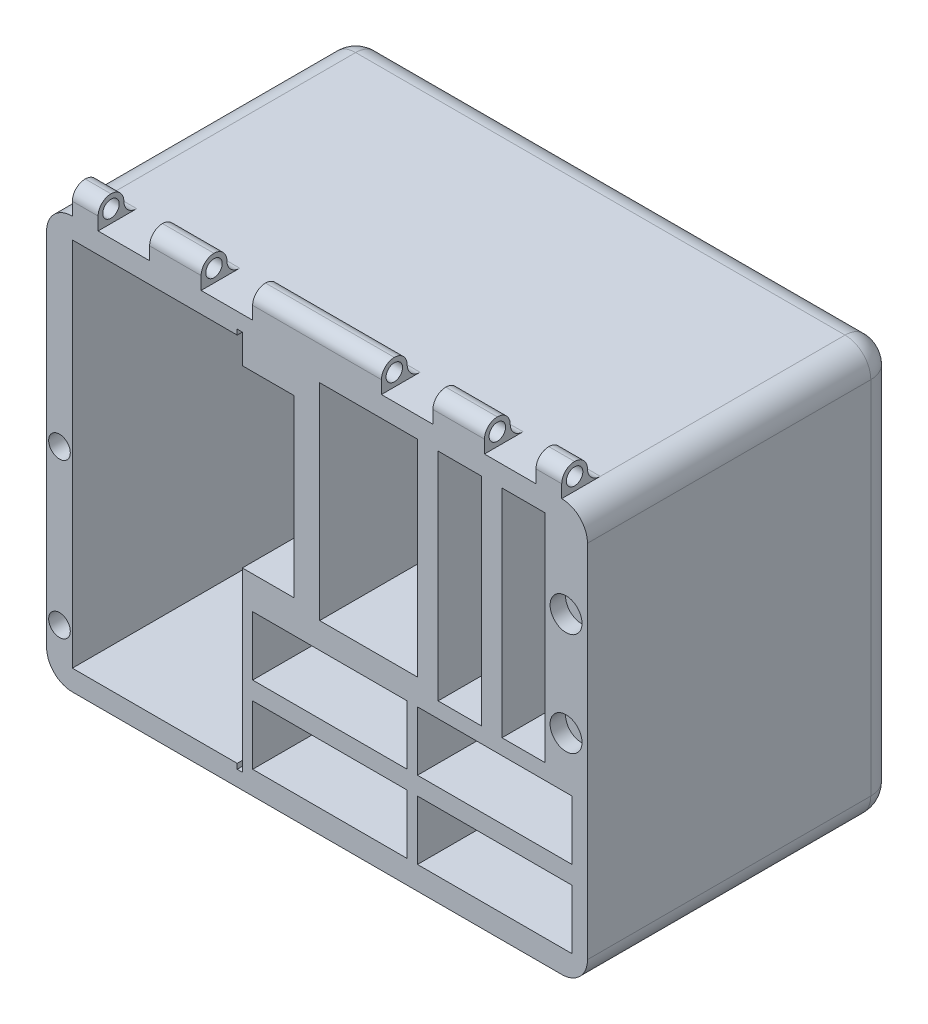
ISO-10303-21;
HEADER;
FILE_DESCRIPTION(('STEP AP214'),'2;1');
FILE_NAME('part.step','',(''),(''),'','','');
FILE_SCHEMA(('AUTOMOTIVE_DESIGN { 1 0 10303 214 1 1 1 1 }'));
ENDSEC;
DATA;
#1=APPLICATION_CONTEXT('core data for automotive mechanical design processes');
#2=APPLICATION_PROTOCOL_DEFINITION('international standard','automotive_design',2000,#1);
#3=PRODUCT_CONTEXT('',#1,'mechanical');
#4=PRODUCT('Part','Part','',(#3));
#5=PRODUCT_RELATED_PRODUCT_CATEGORY('part','',(#4));
#6=PRODUCT_DEFINITION_FORMATION('','',#4);
#7=PRODUCT_DEFINITION_CONTEXT('part definition',#1,'design');
#8=PRODUCT_DEFINITION('design','',#6,#7);
#9=PRODUCT_DEFINITION_SHAPE('','',#8);
#10=(LENGTH_UNIT() NAMED_UNIT(*) SI_UNIT(.MILLI.,.METRE.));
#11=(NAMED_UNIT(*) PLANE_ANGLE_UNIT() SI_UNIT($,.RADIAN.));
#12=(NAMED_UNIT(*) SI_UNIT($,.STERADIAN.) SOLID_ANGLE_UNIT());
#13=UNCERTAINTY_MEASURE_WITH_UNIT(LENGTH_MEASURE(1.E-05),#10,'distance_accuracy_value','');
#14=(GEOMETRIC_REPRESENTATION_CONTEXT(3) GLOBAL_UNCERTAINTY_ASSIGNED_CONTEXT((#13)) GLOBAL_UNIT_ASSIGNED_CONTEXT((#10,
#11,#12)) REPRESENTATION_CONTEXT('',''));
#15=CARTESIAN_POINT('',(0.,0.,0.));
#16=DIRECTION('',(0.,0.,1.));
#17=DIRECTION('',(1.,0.,0.));
#18=AXIS2_PLACEMENT_3D('',#15,#16,#17);
#19=CARTESIAN_POINT('',(0.,0.,60.));
#20=DIRECTION('',(0.,0.,-1.));
#21=DIRECTION('',(-1.,0.,0.));
#22=AXIS2_PLACEMENT_3D('',#19,#20,#21);
#23=PLANE('',#22);
#24=CARTESIAN_POINT('',(48.3429076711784,21.,60.));
#25=DIRECTION('',(0.,0.,1.));
#26=DIRECTION('',(1.,0.,0.));
#27=AXIS2_PLACEMENT_3D('',#24,#25,#26);
#28=CIRCLE('',#27,3.1);
#29=CARTESIAN_POINT('',(51.4429076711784,21.,60.));
#30=VERTEX_POINT('',#29);
#31=EDGE_CURVE('E1231',#30,#30,#28,.T.);
#32=ORIENTED_EDGE('',*,*,#31,.F.);
#33=EDGE_LOOP('',(#32));
#34=FACE_BOUND('',#33,.T.);
#35=CARTESIAN_POINT('',(48.3429076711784,0.999999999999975,60.));
#36=DIRECTION('',(0.,0.,1.));
#37=DIRECTION('',(1.,0.,0.));
#38=AXIS2_PLACEMENT_3D('',#35,#36,#37);
#39=CIRCLE('',#38,3.1);
#40=CARTESIAN_POINT('',(51.4429076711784,0.999999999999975,60.));
#41=VERTEX_POINT('',#40);
#42=EDGE_CURVE('E1237',#41,#41,#39,.T.);
#43=ORIENTED_EDGE('',*,*,#42,.F.);
#44=EDGE_LOOP('',(#43));
#45=FACE_BOUND('',#44,.T.);
#46=CARTESIAN_POINT('',(-50.,-30.,60.));
#47=DIRECTION('',(0.,0.,1.));
#48=DIRECTION('',(1.,0.,0.));
#49=AXIS2_PLACEMENT_3D('',#46,#47,#48);
#50=CIRCLE('',#49,2.1);
#51=CARTESIAN_POINT('',(-47.9,-30.,60.));
#52=VERTEX_POINT('',#51);
#53=EDGE_CURVE('E1225',#52,#52,#50,.T.);
#54=ORIENTED_EDGE('',*,*,#53,.F.);
#55=EDGE_LOOP('',(#54));
#56=FACE_BOUND('',#55,.T.);
#57=CARTESIAN_POINT('',(-50.,0.,60.));
#58=DIRECTION('',(0.,0.,1.));
#59=DIRECTION('',(1.,0.,0.));
#60=AXIS2_PLACEMENT_3D('',#57,#58,#59);
#61=CIRCLE('',#60,2.1);
#62=CARTESIAN_POINT('',(-47.9,0.,60.));
#63=VERTEX_POINT('',#62);
#64=EDGE_CURVE('E1222',#63,#63,#61,.T.);
#65=ORIENTED_EDGE('',*,*,#64,.F.);
#66=EDGE_LOOP('',(#65));
#67=FACE_BOUND('',#66,.T.);
#68=DIRECTION('',(0.,1.,0.));
#69=VECTOR('',#68,1.);
#70=CARTESIAN_POINT('',(-14.5,0.,60.));
#71=LINE('',#70,#69);
#72=CARTESIAN_POINT('',(-14.5,-37.,60.));
#73=VERTEX_POINT('',#72);
#74=CARTESIAN_POINT('',(-14.5,-2.65000000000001,60.));
#75=VERTEX_POINT('',#74);
#76=EDGE_CURVE('E944',#73,#75,#71,.T.);
#77=ORIENTED_EDGE('',*,*,#76,.F.);
#78=DIRECTION('',(1.,0.,0.));
#79=VECTOR('',#78,1.);
#80=CARTESIAN_POINT('',(-15.5,-37.,60.));
#81=LINE('',#80,#79);
#82=CARTESIAN_POINT('',(-15.5,-37.,60.));
#83=VERTEX_POINT('',#82);
#84=EDGE_CURVE('E702',#83,#73,#81,.T.);
#85=ORIENTED_EDGE('',*,*,#84,.F.);
#86=DIRECTION('',(0.,-1.,0.));
#87=VECTOR('',#86,1.);
#88=CARTESIAN_POINT('',(-15.5,-37.,60.));
#89=LINE('',#88,#87);
#90=CARTESIAN_POINT('',(-15.5,-36.,60.));
#91=VERTEX_POINT('',#90);
#92=EDGE_CURVE('E699',#91,#83,#89,.T.);
#93=ORIENTED_EDGE('',*,*,#92,.F.);
#94=DIRECTION('',(1.,0.,0.));
#95=VECTOR('',#94,1.);
#96=CARTESIAN_POINT('',(0.,-36.,60.));
#97=LINE('',#96,#95);
#98=CARTESIAN_POINT('',(-47.5,-36.,60.));
#99=VERTEX_POINT('',#98);
#100=EDGE_CURVE('E955',#99,#91,#97,.T.);
#101=ORIENTED_EDGE('',*,*,#100,.F.);
#102=DIRECTION('',(0.,1.,0.));
#103=VECTOR('',#102,1.);
#104=CARTESIAN_POINT('',(-47.5,0.,60.));
#105=LINE('',#104,#103);
#106=CARTESIAN_POINT('',(-47.5,36.,60.));
#107=VERTEX_POINT('',#106);
#108=EDGE_CURVE('E986',#99,#107,#105,.T.);
#109=ORIENTED_EDGE('',*,*,#108,.T.);
#110=DIRECTION('',(1.,0.,0.));
#111=VECTOR('',#110,1.);
#112=CARTESIAN_POINT('',(0.,36.,60.));
#113=LINE('',#112,#111);
#114=CARTESIAN_POINT('',(-15.5,36.,60.));
#115=VERTEX_POINT('',#114);
#116=EDGE_CURVE('E983',#107,#115,#113,.T.);
#117=ORIENTED_EDGE('',*,*,#116,.T.);
#118=CARTESIAN_POINT('',(-15.5,37.,60.));
#119=VERTEX_POINT('',#118);
#120=EDGE_CURVE('E700',#119,#115,#89,.T.);
#121=ORIENTED_EDGE('',*,*,#120,.F.);
#122=DIRECTION('',(-1.,0.,0.));
#123=VECTOR('',#122,1.);
#124=CARTESIAN_POINT('',(-15.5,37.,60.));
#125=LINE('',#124,#123);
#126=CARTESIAN_POINT('',(-14.5,37.,60.));
#127=VERTEX_POINT('',#126);
#128=EDGE_CURVE('E690',#127,#119,#125,.T.);
#129=ORIENTED_EDGE('',*,*,#128,.F.);
#130=CARTESIAN_POINT('',(-14.5,31.35,60.));
#131=VERTEX_POINT('',#130);
#132=EDGE_CURVE('E974',#131,#127,#71,.T.);
#133=ORIENTED_EDGE('',*,*,#132,.F.);
#134=DIRECTION('',(1.,0.,0.));
#135=VECTOR('',#134,1.);
#136=CARTESIAN_POINT('',(0.,31.35,60.));
#137=LINE('',#136,#135);
#138=CARTESIAN_POINT('',(-4.50000000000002,31.35,60.));
#139=VERTEX_POINT('',#138);
#140=EDGE_CURVE('E980',#131,#139,#137,.T.);
#141=ORIENTED_EDGE('',*,*,#140,.T.);
#142=DIRECTION('',(0.,-1.,0.));
#143=VECTOR('',#142,1.);
#144=CARTESIAN_POINT('',(-4.50000000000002,0.,60.));
#145=LINE('',#144,#143);
#146=CARTESIAN_POINT('',(-4.50000000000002,-2.65000000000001,60.));
#147=VERTEX_POINT('',#146);
#148=EDGE_CURVE('E977',#139,#147,#145,.T.);
#149=ORIENTED_EDGE('',*,*,#148,.T.);
#150=DIRECTION('',(1.,0.,0.));
#151=VECTOR('',#150,1.);
#152=CARTESIAN_POINT('',(0.,-2.65000000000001,60.));
#153=LINE('',#152,#151);
#154=EDGE_CURVE('E973',#75,#147,#153,.T.);
#155=ORIENTED_EDGE('',*,*,#154,.F.);
#156=EDGE_LOOP('',(#77,#85,#93,#101,#109,#117,#121,#129,#133,#141,#149,#155));
#157=FACE_BOUND('',#156,.T.);
#158=DIRECTION('',(1.,0.,0.));
#159=VECTOR('',#158,1.);
#160=CARTESIAN_POINT('',(0.499999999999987,-4.00000000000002,60.));
#161=LINE('',#160,#159);
#162=CARTESIAN_POINT('',(0.499999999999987,-4.00000000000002,60.));
#163=VERTEX_POINT('',#162);
#164=CARTESIAN_POINT('',(19.5,-4.00000000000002,60.));
#165=VERTEX_POINT('',#164);
#166=EDGE_CURVE('E934',#163,#165,#161,.T.);
#167=ORIENTED_EDGE('',*,*,#166,.F.);
#168=DIRECTION('',(0.,-1.,0.));
#169=VECTOR('',#168,1.);
#170=CARTESIAN_POINT('',(0.499999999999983,36.,60.));
#171=LINE('',#170,#169);
#172=CARTESIAN_POINT('',(0.499999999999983,36.,60.));
#173=VERTEX_POINT('',#172);
#174=EDGE_CURVE('E882',#173,#163,#171,.T.);
#175=ORIENTED_EDGE('',*,*,#174,.F.);
#176=DIRECTION('',(-1.,0.,0.));
#177=VECTOR('',#176,1.);
#178=CARTESIAN_POINT('',(0.499999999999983,36.,60.));
#179=LINE('',#178,#177);
#180=CARTESIAN_POINT('',(19.5,36.,60.));
#181=VERTEX_POINT('',#180);
#182=EDGE_CURVE('E923',#181,#173,#179,.T.);
#183=ORIENTED_EDGE('',*,*,#182,.F.);
#184=DIRECTION('',(0.,1.,0.));
#185=VECTOR('',#184,1.);
#186=CARTESIAN_POINT('',(19.5,36.,60.));
#187=LINE('',#186,#185);
#188=EDGE_CURVE('E937',#165,#181,#187,.T.);
#189=ORIENTED_EDGE('',*,*,#188,.F.);
#190=EDGE_LOOP('',(#167,#175,#183,#189));
#191=FACE_BOUND('',#190,.T.);
#192=DIRECTION('',(1.,0.,0.));
#193=VECTOR('',#192,1.);
#194=CARTESIAN_POINT('',(35.9,-6.00000000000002,60.));
#195=LINE('',#194,#193);
#196=CARTESIAN_POINT('',(35.9,-6.00000000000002,60.));
#197=VERTEX_POINT('',#196);
#198=CARTESIAN_POINT('',(44.3,-6.00000000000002,60.));
#199=VERTEX_POINT('',#198);
#200=EDGE_CURVE('E905',#197,#199,#195,.T.);
#201=ORIENTED_EDGE('',*,*,#200,.F.);
#202=DIRECTION('',(0.,-1.,0.));
#203=VECTOR('',#202,1.);
#204=CARTESIAN_POINT('',(35.9,36.,60.));
#205=LINE('',#204,#203);
#206=CARTESIAN_POINT('',(35.9,36.,60.));
#207=VERTEX_POINT('',#206);
#208=EDGE_CURVE('E872',#207,#197,#205,.T.);
#209=ORIENTED_EDGE('',*,*,#208,.F.);
#210=DIRECTION('',(-1.,0.,0.));
#211=VECTOR('',#210,1.);
#212=CARTESIAN_POINT('',(35.9,36.,60.));
#213=LINE('',#212,#211);
#214=CARTESIAN_POINT('',(44.3,36.,60.));
#215=VERTEX_POINT('',#214);
#216=EDGE_CURVE('E898',#215,#207,#213,.T.);
#217=ORIENTED_EDGE('',*,*,#216,.F.);
#218=DIRECTION('',(0.,1.,0.));
#219=VECTOR('',#218,1.);
#220=CARTESIAN_POINT('',(44.3,36.,60.));
#221=LINE('',#220,#219);
#222=EDGE_CURVE('E901',#199,#215,#221,.T.);
#223=ORIENTED_EDGE('',*,*,#222,.F.);
#224=EDGE_LOOP('',(#201,#209,#217,#223));
#225=FACE_BOUND('',#224,.T.);
#226=DIRECTION('',(1.,0.,0.));
#227=VECTOR('',#226,1.);
#228=CARTESIAN_POINT('',(23.5,-6.00000000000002,60.));
#229=LINE('',#228,#227);
#230=CARTESIAN_POINT('',(23.5,-6.00000000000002,60.));
#231=VERTEX_POINT('',#230);
#232=CARTESIAN_POINT('',(31.9,-6.00000000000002,60.));
#233=VERTEX_POINT('',#232);
#234=EDGE_CURVE('E871',#231,#233,#229,.T.);
#235=ORIENTED_EDGE('',*,*,#234,.F.);
#236=DIRECTION('',(0.,-1.,0.));
#237=VECTOR('',#236,1.);
#238=CARTESIAN_POINT('',(23.5,36.,60.));
#239=LINE('',#238,#237);
#240=CARTESIAN_POINT('',(23.5,36.,60.));
#241=VERTEX_POINT('',#240);
#242=EDGE_CURVE('E869',#241,#231,#239,.T.);
#243=ORIENTED_EDGE('',*,*,#242,.F.);
#244=DIRECTION('',(-1.,0.,0.));
#245=VECTOR('',#244,1.);
#246=CARTESIAN_POINT('',(23.5,36.,60.));
#247=LINE('',#246,#245);
#248=CARTESIAN_POINT('',(31.9,36.,60.));
#249=VERTEX_POINT('',#248);
#250=EDGE_CURVE('E859',#249,#241,#247,.T.);
#251=ORIENTED_EDGE('',*,*,#250,.F.);
#252=DIRECTION('',(0.,1.,0.));
#253=VECTOR('',#252,1.);
#254=CARTESIAN_POINT('',(31.9,36.,60.));
#255=LINE('',#254,#253);
#256=EDGE_CURVE('E875',#233,#249,#255,.T.);
#257=ORIENTED_EDGE('',*,*,#256,.F.);
#258=EDGE_LOOP('',(#235,#243,#251,#257));
#259=FACE_BOUND('',#258,.T.);
#260=DIRECTION('',(1.,0.,0.));
#261=VECTOR('',#260,1.);
#262=CARTESIAN_POINT('',(-12.5,-20.5,60.));
#263=LINE('',#262,#261);
#264=CARTESIAN_POINT('',(-12.5,-20.5,60.));
#265=VERTEX_POINT('',#264);
#266=CARTESIAN_POINT('',(17.5,-20.5,60.));
#267=VERTEX_POINT('',#266);
#268=EDGE_CURVE('E838',#265,#267,#263,.T.);
#269=ORIENTED_EDGE('',*,*,#268,.F.);
#270=DIRECTION('',(0.,-1.,0.));
#271=VECTOR('',#270,1.);
#272=CARTESIAN_POINT('',(-12.5,-9.00000000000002,60.));
#273=LINE('',#272,#271);
#274=CARTESIAN_POINT('',(-12.5,-9.00000000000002,60.));
#275=VERTEX_POINT('',#274);
#276=EDGE_CURVE('E782',#275,#265,#273,.T.);
#277=ORIENTED_EDGE('',*,*,#276,.F.);
#278=DIRECTION('',(-1.,0.,0.));
#279=VECTOR('',#278,1.);
#280=CARTESIAN_POINT('',(-12.5,-9.00000000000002,60.));
#281=LINE('',#280,#279);
#282=CARTESIAN_POINT('',(17.5,-9.00000000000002,60.));
#283=VERTEX_POINT('',#282);
#284=EDGE_CURVE('E827',#283,#275,#281,.T.);
#285=ORIENTED_EDGE('',*,*,#284,.F.);
#286=DIRECTION('',(0.,1.,0.));
#287=VECTOR('',#286,1.);
#288=CARTESIAN_POINT('',(17.5,-9.00000000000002,60.));
#289=LINE('',#288,#287);
#290=EDGE_CURVE('E841',#267,#283,#289,.T.);
#291=ORIENTED_EDGE('',*,*,#290,.F.);
#292=EDGE_LOOP('',(#269,#277,#285,#291));
#293=FACE_BOUND('',#292,.T.);
#294=DIRECTION('',(1.,0.,0.));
#295=VECTOR('',#294,1.);
#296=CARTESIAN_POINT('',(19.5000000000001,-35.5,60.));
#297=LINE('',#296,#295);
#298=CARTESIAN_POINT('',(19.5000000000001,-35.5,60.));
#299=VERTEX_POINT('',#298);
#300=CARTESIAN_POINT('',(49.5000000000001,-35.5,60.));
#301=VERTEX_POINT('',#300);
#302=EDGE_CURVE('E743',#299,#301,#297,.T.);
#303=ORIENTED_EDGE('',*,*,#302,.F.);
#304=DIRECTION('',(0.,-1.,0.));
#305=VECTOR('',#304,1.);
#306=CARTESIAN_POINT('',(19.5000000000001,-24.,60.));
#307=LINE('',#306,#305);
#308=CARTESIAN_POINT('',(19.5000000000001,-24.,60.));
#309=VERTEX_POINT('',#308);
#310=EDGE_CURVE('E746',#309,#299,#307,.T.);
#311=ORIENTED_EDGE('',*,*,#310,.F.);
#312=DIRECTION('',(-1.,0.,0.));
#313=VECTOR('',#312,1.);
#314=CARTESIAN_POINT('',(19.5000000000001,-24.,60.));
#315=LINE('',#314,#313);
#316=CARTESIAN_POINT('',(49.5000000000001,-24.,60.));
#317=VERTEX_POINT('',#316);
#318=EDGE_CURVE('E736',#317,#309,#315,.T.);
#319=ORIENTED_EDGE('',*,*,#318,.F.);
#320=DIRECTION('',(0.,1.,0.));
#321=VECTOR('',#320,1.);
#322=CARTESIAN_POINT('',(49.5000000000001,-24.,60.));
#323=LINE('',#322,#321);
#324=EDGE_CURVE('E739',#301,#317,#323,.T.);
#325=ORIENTED_EDGE('',*,*,#324,.F.);
#326=EDGE_LOOP('',(#303,#311,#319,#325));
#327=FACE_BOUND('',#326,.T.);
#328=DIRECTION('',(0.,-1.,0.));
#329=VECTOR('',#328,1.);
#330=CARTESIAN_POINT('',(-12.4999999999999,-24.,60.));
#331=LINE('',#330,#329);
#332=CARTESIAN_POINT('',(-12.4999999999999,-24.,60.));
#333=VERTEX_POINT('',#332);
#334=CARTESIAN_POINT('',(-12.4999999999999,-35.5,60.));
#335=VERTEX_POINT('',#334);
#336=EDGE_CURVE('E809',#333,#335,#331,.T.);
#337=ORIENTED_EDGE('',*,*,#336,.F.);
#338=DIRECTION('',(-1.,0.,0.));
#339=VECTOR('',#338,1.);
#340=CARTESIAN_POINT('',(-12.4999999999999,-24.,60.));
#341=LINE('',#340,#339);
#342=CARTESIAN_POINT('',(17.5000000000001,-24.,60.));
#343=VERTEX_POINT('',#342);
#344=EDGE_CURVE('E769',#343,#333,#341,.T.);
#345=ORIENTED_EDGE('',*,*,#344,.F.);
#346=DIRECTION('',(0.,1.,0.));
#347=VECTOR('',#346,1.);
#348=CARTESIAN_POINT('',(17.5000000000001,-24.,60.));
#349=LINE('',#348,#347);
#350=CARTESIAN_POINT('',(17.5000000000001,-35.5,60.));
#351=VERTEX_POINT('',#350);
#352=EDGE_CURVE('E802',#351,#343,#349,.T.);
#353=ORIENTED_EDGE('',*,*,#352,.F.);
#354=DIRECTION('',(1.,0.,0.));
#355=VECTOR('',#354,1.);
#356=CARTESIAN_POINT('',(-12.4999999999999,-35.5,60.));
#357=LINE('',#356,#355);
#358=EDGE_CURVE('E805',#335,#351,#357,.T.);
#359=ORIENTED_EDGE('',*,*,#358,.F.);
#360=EDGE_LOOP('',(#337,#345,#353,#359));
#361=FACE_BOUND('',#360,.T.);
#362=DIRECTION('',(1.,0.,0.));
#363=VECTOR('',#362,1.);
#364=CARTESIAN_POINT('',(19.5,-20.5,60.));
#365=LINE('',#364,#363);
#366=CARTESIAN_POINT('',(19.5,-20.5,60.));
#367=VERTEX_POINT('',#366);
#368=CARTESIAN_POINT('',(49.5,-20.5,60.));
#369=VERTEX_POINT('',#368);
#370=EDGE_CURVE('E777',#367,#369,#365,.T.);
#371=ORIENTED_EDGE('',*,*,#370,.F.);
#372=DIRECTION('',(0.,-1.,0.));
#373=VECTOR('',#372,1.);
#374=CARTESIAN_POINT('',(19.5,-9.00000000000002,60.));
#375=LINE('',#374,#373);
#376=CARTESIAN_POINT('',(19.5,-9.00000000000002,60.));
#377=VERTEX_POINT('',#376);
#378=EDGE_CURVE('E780',#377,#367,#375,.T.);
#379=ORIENTED_EDGE('',*,*,#378,.F.);
#380=DIRECTION('',(-1.,0.,0.));
#381=VECTOR('',#380,1.);
#382=CARTESIAN_POINT('',(19.5,-9.00000000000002,60.));
#383=LINE('',#382,#381);
#384=CARTESIAN_POINT('',(49.5,-9.00000000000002,60.));
#385=VERTEX_POINT('',#384);
#386=EDGE_CURVE('E770',#385,#377,#383,.T.);
#387=ORIENTED_EDGE('',*,*,#386,.F.);
#388=DIRECTION('',(0.,1.,0.));
#389=VECTOR('',#388,1.);
#390=CARTESIAN_POINT('',(49.5,-9.00000000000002,60.));
#391=LINE('',#390,#389);
#392=EDGE_CURVE('E773',#369,#385,#391,.T.);
#393=ORIENTED_EDGE('',*,*,#392,.F.);
#394=EDGE_LOOP('',(#371,#379,#387,#393));
#395=FACE_BOUND('',#394,.T.);
#396=DIRECTION('',(0.,-1.,0.));
#397=VECTOR('',#396,1.);
#398=CARTESIAN_POINT('',(-32.5,0.,60.));
#399=LINE('',#398,#397);
#400=CARTESIAN_POINT('',(-32.5,42.5,60.));
#401=VERTEX_POINT('',#400);
#402=CARTESIAN_POINT('',(-32.5,40.,60.));
#403=VERTEX_POINT('',#402);
#404=EDGE_CURVE('E569',#401,#403,#399,.T.);
#405=ORIENTED_EDGE('',*,*,#404,.T.);
#406=DIRECTION('',(1.,0.,0.));
#407=VECTOR('',#406,1.);
#408=CARTESIAN_POINT('',(0.,40.,60.));
#409=LINE('',#408,#407);
#410=CARTESIAN_POINT('',(-42.5,40.,60.));
#411=VERTEX_POINT('',#410);
#412=EDGE_CURVE('E552',#411,#403,#409,.T.);
#413=ORIENTED_EDGE('',*,*,#412,.F.);
#414=DIRECTION('',(0.,-1.,0.));
#415=VECTOR('',#414,1.);
#416=CARTESIAN_POINT('',(-42.5,0.,60.));
#417=LINE('',#416,#415);
#418=CARTESIAN_POINT('',(-42.5,42.5,60.));
#419=VERTEX_POINT('',#418);
#420=EDGE_CURVE('E562',#419,#411,#417,.T.);
#421=ORIENTED_EDGE('',*,*,#420,.F.);
#422=DIRECTION('',(1.,0.,0.));
#423=VECTOR('',#422,1.);
#424=CARTESIAN_POINT('',(0.,42.5,60.));
#425=LINE('',#424,#423);
#426=CARTESIAN_POINT('',(-47.5,42.5,60.));
#427=VERTEX_POINT('',#426);
#428=EDGE_CURVE('E1101',#419,#427,#425,.F.);
#429=ORIENTED_EDGE('',*,*,#428,.T.);
#430=DIRECTION('',(0.,-1.,0.));
#431=VECTOR('',#430,1.);
#432=CARTESIAN_POINT('',(-47.5,45.,60.));
#433=LINE('',#432,#431);
#434=CARTESIAN_POINT('',(-47.5,40.,60.));
#435=VERTEX_POINT('',#434);
#436=EDGE_CURVE('E688',#427,#435,#433,.T.);
#437=ORIENTED_EDGE('',*,*,#436,.T.);
#438=CARTESIAN_POINT('',(-47.5,35.,60.));
#439=DIRECTION('',(0.,0.,-1.));
#440=DIRECTION('',(-1.,0.,0.));
#441=AXIS2_PLACEMENT_3D('',#438,#439,#440);
#442=CIRCLE('',#441,5.);
#443=CARTESIAN_POINT('',(-52.5,35.,60.));
#444=VERTEX_POINT('',#443);
#445=EDGE_CURVE('E1024',#435,#444,#442,.F.);
#446=ORIENTED_EDGE('',*,*,#445,.T.);
#447=DIRECTION('',(0.,-1.,0.));
#448=VECTOR('',#447,1.);
#449=CARTESIAN_POINT('',(-52.5,-40.,60.));
#450=LINE('',#449,#448);
#451=CARTESIAN_POINT('',(-52.5,-35.,60.));
#452=VERTEX_POINT('',#451);
#453=EDGE_CURVE('E1006',#444,#452,#450,.T.);
#454=ORIENTED_EDGE('',*,*,#453,.T.);
#455=CARTESIAN_POINT('',(-47.5,-35.,60.));
#456=DIRECTION('',(0.,0.,-1.));
#457=DIRECTION('',(-1.,0.,0.));
#458=AXIS2_PLACEMENT_3D('',#455,#456,#457);
#459=CIRCLE('',#458,5.);
#460=CARTESIAN_POINT('',(-47.5,-40.,60.));
#461=VERTEX_POINT('',#460);
#462=EDGE_CURVE('E1022',#452,#461,#459,.F.);
#463=ORIENTED_EDGE('',*,*,#462,.T.);
#464=DIRECTION('',(1.,0.,0.));
#465=VECTOR('',#464,1.);
#466=CARTESIAN_POINT('',(-52.5,-40.,60.));
#467=LINE('',#466,#465);
#468=CARTESIAN_POINT('',(47.5,-40.,60.));
#469=VERTEX_POINT('',#468);
#470=EDGE_CURVE('E1009',#461,#469,#467,.T.);
#471=ORIENTED_EDGE('',*,*,#470,.T.);
#472=CARTESIAN_POINT('',(47.5,-35.,60.));
#473=DIRECTION('',(0.,0.,-1.));
#474=DIRECTION('',(-1.,0.,0.));
#475=AXIS2_PLACEMENT_3D('',#472,#473,#474);
#476=CIRCLE('',#475,5.);
#477=CARTESIAN_POINT('',(52.5,-35.,60.));
#478=VERTEX_POINT('',#477);
#479=EDGE_CURVE('E1029',#469,#478,#476,.F.);
#480=ORIENTED_EDGE('',*,*,#479,.T.);
#481=DIRECTION('',(0.,1.,0.));
#482=VECTOR('',#481,1.);
#483=CARTESIAN_POINT('',(52.5,-40.,60.));
#484=LINE('',#483,#482);
#485=CARTESIAN_POINT('',(52.5,35.,60.));
#486=VERTEX_POINT('',#485);
#487=EDGE_CURVE('E993',#478,#486,#484,.T.);
#488=ORIENTED_EDGE('',*,*,#487,.T.);
#489=CARTESIAN_POINT('',(47.5,35.,60.));
#490=DIRECTION('',(0.,0.,-1.));
#491=DIRECTION('',(-1.,0.,0.));
#492=AXIS2_PLACEMENT_3D('',#489,#490,#491);
#493=CIRCLE('',#492,5.);
#494=CARTESIAN_POINT('',(47.5,40.,60.));
#495=VERTEX_POINT('',#494);
#496=EDGE_CURVE('E1026',#486,#495,#493,.F.);
#497=ORIENTED_EDGE('',*,*,#496,.T.);
#498=DIRECTION('',(0.,-1.,0.));
#499=VECTOR('',#498,1.);
#500=CARTESIAN_POINT('',(47.5,45.,60.));
#501=LINE('',#500,#499);
#502=CARTESIAN_POINT('',(47.5,42.5,60.));
#503=VERTEX_POINT('',#502);
#504=EDGE_CURVE('E686',#503,#495,#501,.T.);
#505=ORIENTED_EDGE('',*,*,#504,.F.);
#506=CARTESIAN_POINT('',(42.5,42.5,60.));
#507=VERTEX_POINT('',#506);
#508=EDGE_CURVE('E1102',#503,#507,#425,.F.);
#509=ORIENTED_EDGE('',*,*,#508,.T.);
#510=DIRECTION('',(0.,-1.,0.));
#511=VECTOR('',#510,1.);
#512=CARTESIAN_POINT('',(42.5,0.,60.));
#513=LINE('',#512,#511);
#514=CARTESIAN_POINT('',(42.5,40.,60.));
#515=VERTEX_POINT('',#514);
#516=EDGE_CURVE('E587',#507,#515,#513,.T.);
#517=ORIENTED_EDGE('',*,*,#516,.T.);
#518=DIRECTION('',(1.,0.,0.));
#519=VECTOR('',#518,1.);
#520=CARTESIAN_POINT('',(0.,40.,60.));
#521=LINE('',#520,#519);
#522=CARTESIAN_POINT('',(32.5,40.,60.));
#523=VERTEX_POINT('',#522);
#524=EDGE_CURVE('E590',#523,#515,#521,.T.);
#525=ORIENTED_EDGE('',*,*,#524,.F.);
#526=DIRECTION('',(0.,-1.,0.));
#527=VECTOR('',#526,1.);
#528=CARTESIAN_POINT('',(32.5,0.,60.));
#529=LINE('',#528,#527);
#530=CARTESIAN_POINT('',(32.5,42.5,60.));
#531=VERTEX_POINT('',#530);
#532=EDGE_CURVE('E596',#531,#523,#529,.T.);
#533=ORIENTED_EDGE('',*,*,#532,.F.);
#534=CARTESIAN_POINT('',(22.5,42.5,60.));
#535=VERTEX_POINT('',#534);
#536=EDGE_CURVE('E1106',#531,#535,#425,.F.);
#537=ORIENTED_EDGE('',*,*,#536,.T.);
#538=DIRECTION('',(0.,-1.,0.));
#539=VECTOR('',#538,1.);
#540=CARTESIAN_POINT('',(22.5,45.,60.));
#541=LINE('',#540,#539);
#542=CARTESIAN_POINT('',(22.5,40.,60.));
#543=VERTEX_POINT('',#542);
#544=EDGE_CURVE('E579',#535,#543,#541,.T.);
#545=ORIENTED_EDGE('',*,*,#544,.T.);
#546=DIRECTION('',(1.,0.,0.));
#547=VECTOR('',#546,1.);
#548=CARTESIAN_POINT('',(0.,40.,60.));
#549=LINE('',#548,#547);
#550=CARTESIAN_POINT('',(12.5,40.,60.));
#551=VERTEX_POINT('',#550);
#552=EDGE_CURVE('E580',#551,#543,#549,.T.);
#553=ORIENTED_EDGE('',*,*,#552,.F.);
#554=DIRECTION('',(0.,-1.,0.));
#555=VECTOR('',#554,1.);
#556=CARTESIAN_POINT('',(12.5,45.,60.));
#557=LINE('',#556,#555);
#558=CARTESIAN_POINT('',(12.5,42.5,60.));
#559=VERTEX_POINT('',#558);
#560=EDGE_CURVE('E577',#559,#551,#557,.T.);
#561=ORIENTED_EDGE('',*,*,#560,.F.);
#562=CARTESIAN_POINT('',(-12.5,42.5,60.));
#563=VERTEX_POINT('',#562);
#564=EDGE_CURVE('E1147',#559,#563,#425,.F.);
#565=ORIENTED_EDGE('',*,*,#564,.T.);
#566=DIRECTION('',(0.,-1.,0.));
#567=VECTOR('',#566,1.);
#568=CARTESIAN_POINT('',(-12.5,45.,60.));
#569=LINE('',#568,#567);
#570=CARTESIAN_POINT('',(-12.5,40.,60.));
#571=VERTEX_POINT('',#570);
#572=EDGE_CURVE('E600',#563,#571,#569,.T.);
#573=ORIENTED_EDGE('',*,*,#572,.T.);
#574=DIRECTION('',(1.,0.,0.));
#575=VECTOR('',#574,1.);
#576=CARTESIAN_POINT('',(0.,40.,60.));
#577=LINE('',#576,#575);
#578=CARTESIAN_POINT('',(-22.5,40.,60.));
#579=VERTEX_POINT('',#578);
#580=EDGE_CURVE('E603',#579,#571,#577,.T.);
#581=ORIENTED_EDGE('',*,*,#580,.F.);
#582=DIRECTION('',(0.,-1.,0.));
#583=VECTOR('',#582,1.);
#584=CARTESIAN_POINT('',(-22.5,45.,60.));
#585=LINE('',#584,#583);
#586=CARTESIAN_POINT('',(-22.5,42.5,60.));
#587=VERTEX_POINT('',#586);
#588=EDGE_CURVE('E593',#587,#579,#585,.T.);
#589=ORIENTED_EDGE('',*,*,#588,.F.);
#590=EDGE_CURVE('E1146',#587,#401,#425,.F.);
#591=ORIENTED_EDGE('',*,*,#590,.T.);
#592=EDGE_LOOP('',(#405,#413,#421,#429,#437,#446,#454,#463,#471,#480,#488,#497,#505,#509,#517,
#525,#533,#537,#545,#553,#561,#565,#573,#581,#589,#591));
#593=FACE_BOUND('',#592,.T.);
#594=ADVANCED_FACE('F87',(#34,#45,#56,#67,#157,#191,#225,#259,#293,#327,#361,#395,#593),#23,.F.);
#595=CARTESIAN_POINT('',(-52.5,42.5,57.5));
#596=DIRECTION('',(1.,0.,0.));
#597=DIRECTION('',(0.,0.,-1.));
#598=AXIS2_PLACEMENT_3D('',#595,#596,#597);
#599=CYLINDRICAL_SURFACE('',#598,1.6);
#600=CARTESIAN_POINT('',(47.5,42.5,57.5));
#601=DIRECTION('',(1.,0.,0.));
#602=DIRECTION('',(0.,0.,-1.));
#603=AXIS2_PLACEMENT_3D('',#600,#601,#602);
#604=CIRCLE('',#603,1.6);
#605=CARTESIAN_POINT('',(47.5,42.5,55.9));
#606=VERTEX_POINT('',#605);
#607=EDGE_CURVE('E676',#606,#606,#604,.T.);
#608=ORIENTED_EDGE('',*,*,#607,.T.);
#609=EDGE_LOOP('',(#608));
#610=FACE_BOUND('',#609,.T.);
#611=CARTESIAN_POINT('',(42.5,42.5,57.5));
#612=DIRECTION('',(-1.,0.,0.));
#613=DIRECTION('',(0.,0.,1.));
#614=AXIS2_PLACEMENT_3D('',#611,#612,#613);
#615=CIRCLE('',#614,1.6);
#616=CARTESIAN_POINT('',(42.5,42.5,59.1));
#617=VERTEX_POINT('',#616);
#618=EDGE_CURVE('E641',#617,#617,#615,.F.);
#619=ORIENTED_EDGE('',*,*,#618,.F.);
#620=EDGE_LOOP('',(#619));
#621=FACE_BOUND('',#620,.T.);
#622=ADVANCED_FACE('F1250',(#610,#621),#599,.F.);
#623=CARTESIAN_POINT('',(0.,42.5,57.5));
#624=DIRECTION('',(1.,0.,0.));
#625=DIRECTION('',(0.,0.,-1.));
#626=AXIS2_PLACEMENT_3D('',#623,#624,#625);
#627=CYLINDRICAL_SURFACE('',#626,2.5);
#628=DIRECTION('',(1.,0.,0.));
#629=VECTOR('',#628,1.);
#630=CARTESIAN_POINT('',(0.,45.,57.5));
#631=LINE('',#630,#629);
#632=CARTESIAN_POINT('',(-32.5,45.,57.5));
#633=VERTEX_POINT('',#632);
#634=CARTESIAN_POINT('',(-22.5,45.,57.5));
#635=VERTEX_POINT('',#634);
#636=EDGE_CURVE('E1120',#633,#635,#631,.T.);
#637=ORIENTED_EDGE('',*,*,#636,.F.);
#638=CARTESIAN_POINT('',(-32.5,42.5,57.5));
#639=DIRECTION('',(-1.,0.,0.));
#640=DIRECTION('',(0.,0.,1.));
#641=AXIS2_PLACEMENT_3D('',#638,#639,#640);
#642=CIRCLE('',#641,2.5);
#643=EDGE_CURVE('E669',#633,#401,#642,.F.);
#644=ORIENTED_EDGE('',*,*,#643,.T.);
#645=ORIENTED_EDGE('',*,*,#590,.F.);
#646=CARTESIAN_POINT('',(-22.5,42.5,57.5));
#647=DIRECTION('',(-1.,0.,0.));
#648=DIRECTION('',(0.,0.,1.));
#649=AXIS2_PLACEMENT_3D('',#646,#647,#648);
#650=CIRCLE('',#649,2.5);
#651=EDGE_CURVE('E614',#635,#587,#650,.F.);
#652=ORIENTED_EDGE('',*,*,#651,.F.);
#653=EDGE_LOOP('',(#637,#644,#645,#652));
#654=FACE_BOUND('',#653,.T.);
#655=ADVANCED_FACE('F1207',(#654),#627,.T.);
#656=CARTESIAN_POINT('',(22.5,45.,57.5));
#657=VERTEX_POINT('',#656);
#658=CARTESIAN_POINT('',(32.5,45.,57.5));
#659=VERTEX_POINT('',#658);
#660=EDGE_CURVE('E1163',#657,#659,#631,.T.);
#661=ORIENTED_EDGE('',*,*,#660,.F.);
#662=CARTESIAN_POINT('',(22.5,42.5,57.5));
#663=DIRECTION('',(-1.,0.,0.));
#664=DIRECTION('',(0.,0.,1.));
#665=AXIS2_PLACEMENT_3D('',#662,#663,#664);
#666=CIRCLE('',#665,2.5);
#667=EDGE_CURVE('E647',#657,#535,#666,.F.);
#668=ORIENTED_EDGE('',*,*,#667,.T.);
#669=ORIENTED_EDGE('',*,*,#536,.F.);
#670=CARTESIAN_POINT('',(32.5,42.5,57.5));
#671=DIRECTION('',(-1.,0.,0.));
#672=DIRECTION('',(0.,0.,1.));
#673=AXIS2_PLACEMENT_3D('',#670,#671,#672);
#674=CIRCLE('',#673,2.5);
#675=EDGE_CURVE('E630',#659,#531,#674,.F.);
#676=ORIENTED_EDGE('',*,*,#675,.F.);
#677=EDGE_LOOP('',(#661,#668,#669,#676));
#678=FACE_BOUND('',#677,.T.);
#679=ADVANCED_FACE('F1161',(#678),#627,.T.);
#680=CARTESIAN_POINT('',(42.5,45.,57.5));
#681=VERTEX_POINT('',#680);
#682=CARTESIAN_POINT('',(47.5,45.,57.5));
#683=VERTEX_POINT('',#682);
#684=EDGE_CURVE('E1116',#681,#683,#631,.T.);
#685=ORIENTED_EDGE('',*,*,#684,.F.);
#686=CARTESIAN_POINT('',(42.5,42.5,57.5));
#687=DIRECTION('',(-1.,0.,0.));
#688=DIRECTION('',(0.,0.,1.));
#689=AXIS2_PLACEMENT_3D('',#686,#687,#688);
#690=CIRCLE('',#689,2.5);
#691=EDGE_CURVE('E638',#681,#507,#690,.F.);
#692=ORIENTED_EDGE('',*,*,#691,.T.);
#693=ORIENTED_EDGE('',*,*,#508,.F.);
#694=CARTESIAN_POINT('',(47.5,42.5,57.5));
#695=DIRECTION('',(-1.,0.,0.));
#696=DIRECTION('',(0.,0.,1.));
#697=AXIS2_PLACEMENT_3D('',#694,#695,#696);
#698=CIRCLE('',#697,2.5);
#699=EDGE_CURVE('E1096',#683,#503,#698,.F.);
#700=ORIENTED_EDGE('',*,*,#699,.F.);
#701=EDGE_LOOP('',(#685,#692,#693,#700));
#702=FACE_BOUND('',#701,.T.);
#703=ADVANCED_FACE('F1547',(#702),#627,.T.);
#704=CARTESIAN_POINT('',(12.5,42.5,57.5));
#705=DIRECTION('',(-1.,0.,0.));
#706=DIRECTION('',(0.,-1.,0.));
#707=AXIS2_PLACEMENT_3D('',#704,#705,#706);
#708=CIRCLE('',#707,2.5);
#709=CARTESIAN_POINT('',(12.5,45.,57.5));
#710=VERTEX_POINT('',#709);
#711=EDGE_CURVE('E655',#710,#559,#708,.F.);
#712=ORIENTED_EDGE('',*,*,#711,.F.);
#713=CARTESIAN_POINT('',(-12.5,45.,57.5));
#714=VERTEX_POINT('',#713);
#715=EDGE_CURVE('E1193',#714,#710,#631,.T.);
#716=ORIENTED_EDGE('',*,*,#715,.F.);
#717=CARTESIAN_POINT('',(-12.5,42.5,57.5));
#718=DIRECTION('',(-1.,0.,0.));
#719=DIRECTION('',(0.,-1.,0.));
#720=AXIS2_PLACEMENT_3D('',#717,#718,#719);
#721=CIRCLE('',#720,2.5);
#722=EDGE_CURVE('E622',#714,#563,#721,.F.);
#723=ORIENTED_EDGE('',*,*,#722,.T.);
#724=ORIENTED_EDGE('',*,*,#564,.F.);
#725=EDGE_LOOP('',(#712,#716,#723,#724));
#726=FACE_BOUND('',#725,.T.);
#727=ADVANCED_FACE('F1520',(#726),#627,.T.);
#728=CARTESIAN_POINT('',(0.,42.5,57.5));
#729=DIRECTION('',(-1.,0.,0.));
#730=DIRECTION('',(0.,0.,1.));
#731=AXIS2_PLACEMENT_3D('',#728,#729,#730);
#732=CYLINDRICAL_SURFACE('',#731,2.5);
#733=DIRECTION('',(-1.,0.,0.));
#734=VECTOR('',#733,1.);
#735=CARTESIAN_POINT('',(-47.5,42.5,55.));
#736=LINE('',#735,#734);
#737=CARTESIAN_POINT('',(-32.5,42.5,55.));
#738=VERTEX_POINT('',#737);
#739=CARTESIAN_POINT('',(-22.5,42.5,55.));
#740=VERTEX_POINT('',#739);
#741=EDGE_CURVE('E1117',#738,#740,#736,.F.);
#742=ORIENTED_EDGE('',*,*,#741,.F.);
#743=CARTESIAN_POINT('',(-32.5,42.5,57.5));
#744=DIRECTION('',(-1.,0.,0.));
#745=DIRECTION('',(0.,0.,1.));
#746=AXIS2_PLACEMENT_3D('',#743,#744,#745);
#747=CIRCLE('',#746,2.5);
#748=EDGE_CURVE('E666',#738,#633,#747,.F.);
#749=ORIENTED_EDGE('',*,*,#748,.T.);
#750=ORIENTED_EDGE('',*,*,#636,.T.);
#751=CARTESIAN_POINT('',(-22.5,42.5,57.5));
#752=DIRECTION('',(-1.,0.,0.));
#753=DIRECTION('',(0.,0.,1.));
#754=AXIS2_PLACEMENT_3D('',#751,#752,#753);
#755=CIRCLE('',#754,2.5);
#756=EDGE_CURVE('E575',#740,#635,#755,.F.);
#757=ORIENTED_EDGE('',*,*,#756,.F.);
#758=EDGE_LOOP('',(#742,#749,#750,#757));
#759=FACE_BOUND('',#758,.T.);
#760=ADVANCED_FACE('F1203',(#759),#732,.T.);
#761=CARTESIAN_POINT('',(22.5,42.5,55.));
#762=VERTEX_POINT('',#761);
#763=CARTESIAN_POINT('',(32.5,42.5,55.));
#764=VERTEX_POINT('',#763);
#765=EDGE_CURVE('E1173',#762,#764,#736,.F.);
#766=ORIENTED_EDGE('',*,*,#765,.F.);
#767=CARTESIAN_POINT('',(22.5,42.5,57.5));
#768=DIRECTION('',(-1.,0.,0.));
#769=DIRECTION('',(0.,0.,1.));
#770=AXIS2_PLACEMENT_3D('',#767,#768,#769);
#771=CIRCLE('',#770,2.5);
#772=EDGE_CURVE('E644',#762,#657,#771,.F.);
#773=ORIENTED_EDGE('',*,*,#772,.T.);
#774=ORIENTED_EDGE('',*,*,#660,.T.);
#775=CARTESIAN_POINT('',(32.5,42.5,57.5));
#776=DIRECTION('',(-1.,0.,0.));
#777=DIRECTION('',(0.,0.,1.));
#778=AXIS2_PLACEMENT_3D('',#775,#776,#777);
#779=CIRCLE('',#778,2.5);
#780=EDGE_CURVE('E628',#764,#659,#779,.F.);
#781=ORIENTED_EDGE('',*,*,#780,.F.);
#782=EDGE_LOOP('',(#766,#773,#774,#781));
#783=FACE_BOUND('',#782,.T.);
#784=ADVANCED_FACE('F1170',(#783),#732,.T.);
#785=CARTESIAN_POINT('',(42.5,42.5,55.));
#786=VERTEX_POINT('',#785);
#787=CARTESIAN_POINT('',(47.5,42.5,55.));
#788=VERTEX_POINT('',#787);
#789=EDGE_CURVE('E675',#786,#788,#736,.F.);
#790=ORIENTED_EDGE('',*,*,#789,.F.);
#791=CARTESIAN_POINT('',(42.5,42.5,57.5));
#792=DIRECTION('',(-1.,0.,0.));
#793=DIRECTION('',(0.,0.,1.));
#794=AXIS2_PLACEMENT_3D('',#791,#792,#793);
#795=CIRCLE('',#794,2.5);
#796=EDGE_CURVE('E635',#786,#681,#795,.F.);
#797=ORIENTED_EDGE('',*,*,#796,.T.);
#798=ORIENTED_EDGE('',*,*,#684,.T.);
#799=CARTESIAN_POINT('',(47.5,42.5,57.5));
#800=DIRECTION('',(-1.,0.,0.));
#801=DIRECTION('',(0.,0.,1.));
#802=AXIS2_PLACEMENT_3D('',#799,#800,#801);
#803=CIRCLE('',#802,2.5);
#804=EDGE_CURVE('E1098',#788,#683,#803,.F.);
#805=ORIENTED_EDGE('',*,*,#804,.F.);
#806=EDGE_LOOP('',(#790,#797,#798,#805));
#807=FACE_BOUND('',#806,.T.);
#808=ADVANCED_FACE('F1190',(#807),#732,.T.);
#809=CARTESIAN_POINT('',(12.5,42.5,57.5));
#810=DIRECTION('',(-1.,0.,0.));
#811=DIRECTION('',(0.,-1.,0.));
#812=AXIS2_PLACEMENT_3D('',#809,#810,#811);
#813=CIRCLE('',#812,2.5);
#814=CARTESIAN_POINT('',(12.5,42.5,55.));
#815=VERTEX_POINT('',#814);
#816=EDGE_CURVE('E653',#815,#710,#813,.F.);
#817=ORIENTED_EDGE('',*,*,#816,.F.);
#818=CARTESIAN_POINT('',(-12.5,42.5,55.));
#819=VERTEX_POINT('',#818);
#820=EDGE_CURVE('E1175',#819,#815,#736,.F.);
#821=ORIENTED_EDGE('',*,*,#820,.F.);
#822=CARTESIAN_POINT('',(-12.5,42.5,57.5));
#823=DIRECTION('',(-1.,0.,0.));
#824=DIRECTION('',(0.,-1.,0.));
#825=AXIS2_PLACEMENT_3D('',#822,#823,#824);
#826=CIRCLE('',#825,2.5);
#827=EDGE_CURVE('E619',#819,#714,#826,.F.);
#828=ORIENTED_EDGE('',*,*,#827,.T.);
#829=ORIENTED_EDGE('',*,*,#715,.T.);
#830=EDGE_LOOP('',(#817,#821,#828,#829));
#831=FACE_BOUND('',#830,.T.);
#832=ADVANCED_FACE('F1515',(#831),#732,.T.);
#833=CARTESIAN_POINT('',(-47.5,42.5,52.5));
#834=DIRECTION('',(1.,0.,0.));
#835=DIRECTION('',(0.,0.,-1.));
#836=AXIS2_PLACEMENT_3D('',#833,#834,#835);
#837=CYLINDRICAL_SURFACE('',#836,2.5);
#838=CARTESIAN_POINT('',(-32.5,42.5,52.5));
#839=DIRECTION('',(-1.,0.,0.));
#840=DIRECTION('',(0.,0.,1.));
#841=AXIS2_PLACEMENT_3D('',#838,#839,#840);
#842=CIRCLE('',#841,2.5);
#843=CARTESIAN_POINT('',(-32.5,40.,52.5));
#844=VERTEX_POINT('',#843);
#845=EDGE_CURVE('E12',#738,#844,#842,.F.);
#846=ORIENTED_EDGE('',*,*,#845,.F.);
#847=ORIENTED_EDGE('',*,*,#741,.T.);
#848=CARTESIAN_POINT('',(-22.5,42.5,52.5));
#849=DIRECTION('',(-1.,0.,0.));
#850=DIRECTION('',(0.,0.,1.));
#851=AXIS2_PLACEMENT_3D('',#848,#849,#850);
#852=CIRCLE('',#851,2.5);
#853=CARTESIAN_POINT('',(-22.5,40.,52.5));
#854=VERTEX_POINT('',#853);
#855=EDGE_CURVE('E1112',#740,#854,#852,.F.);
#856=ORIENTED_EDGE('',*,*,#855,.T.);
#857=DIRECTION('',(-1.,0.,0.));
#858=VECTOR('',#857,1.);
#859=CARTESIAN_POINT('',(47.5,40.,52.5));
#860=LINE('',#859,#858);
#861=EDGE_CURVE('E1092',#844,#854,#860,.F.);
#862=ORIENTED_EDGE('',*,*,#861,.F.);
#863=EDGE_LOOP('',(#846,#847,#856,#862));
#864=FACE_BOUND('',#863,.T.);
#865=ADVANCED_FACE('F1217',(#864),#837,.F.);
#866=CARTESIAN_POINT('',(22.5,42.5,52.5));
#867=DIRECTION('',(-1.,0.,0.));
#868=DIRECTION('',(0.,0.,1.));
#869=AXIS2_PLACEMENT_3D('',#866,#867,#868);
#870=CIRCLE('',#869,2.5);
#871=CARTESIAN_POINT('',(22.5,40.,52.5));
#872=VERTEX_POINT('',#871);
#873=EDGE_CURVE('E1130',#762,#872,#870,.F.);
#874=ORIENTED_EDGE('',*,*,#873,.F.);
#875=ORIENTED_EDGE('',*,*,#765,.T.);
#876=CARTESIAN_POINT('',(32.5,42.5,52.5));
#877=DIRECTION('',(-1.,0.,0.));
#878=DIRECTION('',(0.,0.,1.));
#879=AXIS2_PLACEMENT_3D('',#876,#877,#878);
#880=CIRCLE('',#879,2.5);
#881=CARTESIAN_POINT('',(32.5,40.,52.5));
#882=VERTEX_POINT('',#881);
#883=EDGE_CURVE('E1126',#764,#882,#880,.F.);
#884=ORIENTED_EDGE('',*,*,#883,.T.);
#885=EDGE_CURVE('E1540',#872,#882,#860,.F.);
#886=ORIENTED_EDGE('',*,*,#885,.F.);
#887=EDGE_LOOP('',(#874,#875,#884,#886));
#888=FACE_BOUND('',#887,.T.);
#889=ADVANCED_FACE('F1527',(#888),#837,.F.);
#890=CARTESIAN_POINT('',(42.5,42.5,52.5));
#891=DIRECTION('',(-1.,0.,0.));
#892=DIRECTION('',(0.,0.,1.));
#893=AXIS2_PLACEMENT_3D('',#890,#891,#892);
#894=CIRCLE('',#893,2.5);
#895=CARTESIAN_POINT('',(42.5,40.,52.5));
#896=VERTEX_POINT('',#895);
#897=EDGE_CURVE('E1128',#786,#896,#894,.F.);
#898=ORIENTED_EDGE('',*,*,#897,.F.);
#899=ORIENTED_EDGE('',*,*,#789,.T.);
#900=CARTESIAN_POINT('',(47.5,42.5,52.5));
#901=DIRECTION('',(-1.,0.,0.));
#902=DIRECTION('',(0.,0.,1.));
#903=AXIS2_PLACEMENT_3D('',#900,#901,#902);
#904=CIRCLE('',#903,2.5);
#905=CARTESIAN_POINT('',(47.5,40.,52.5));
#906=VERTEX_POINT('',#905);
#907=EDGE_CURVE('E1109',#906,#788,#904,.T.);
#908=ORIENTED_EDGE('',*,*,#907,.F.);
#909=EDGE_CURVE('E1069',#896,#906,#860,.F.);
#910=ORIENTED_EDGE('',*,*,#909,.F.);
#911=EDGE_LOOP('',(#898,#899,#908,#910));
#912=FACE_BOUND('',#911,.T.);
#913=ADVANCED_FACE('F1181',(#912),#837,.F.);
#914=ORIENTED_EDGE('',*,*,#820,.T.);
#915=CARTESIAN_POINT('',(12.5,42.5,52.5));
#916=DIRECTION('',(-1.,0.,0.));
#917=DIRECTION('',(0.,-1.,0.));
#918=AXIS2_PLACEMENT_3D('',#915,#916,#917);
#919=CIRCLE('',#918,2.5);
#920=CARTESIAN_POINT('',(12.5,40.,52.5));
#921=VERTEX_POINT('',#920);
#922=EDGE_CURVE('E1132',#815,#921,#919,.F.);
#923=ORIENTED_EDGE('',*,*,#922,.T.);
#924=CARTESIAN_POINT('',(-12.5,40.,52.5));
#925=VERTEX_POINT('',#924);
#926=EDGE_CURVE('E1534',#925,#921,#860,.F.);
#927=ORIENTED_EDGE('',*,*,#926,.F.);
#928=CARTESIAN_POINT('',(-12.5,42.5,52.5));
#929=DIRECTION('',(-1.,0.,0.));
#930=DIRECTION('',(0.,-1.,0.));
#931=AXIS2_PLACEMENT_3D('',#928,#929,#930);
#932=CIRCLE('',#931,2.5);
#933=EDGE_CURVE('E1123',#819,#925,#932,.F.);
#934=ORIENTED_EDGE('',*,*,#933,.F.);
#935=EDGE_LOOP('',(#914,#923,#927,#934));
#936=FACE_BOUND('',#935,.T.);
#937=ADVANCED_FACE('F1466',(#936),#837,.F.);
#938=CARTESIAN_POINT('',(-52.5,40.,60.));
#939=DIRECTION('',(0.,-1.,0.));
#940=DIRECTION('',(0.,0.,-1.));
#941=AXIS2_PLACEMENT_3D('',#938,#939,#940);
#942=PLANE('',#941);
#943=CARTESIAN_POINT('',(-47.5,40.,52.5));
#944=VERTEX_POINT('',#943);
#945=CARTESIAN_POINT('',(-42.5,40.,52.5));
#946=VERTEX_POINT('',#945);
#947=EDGE_CURVE('E556',#944,#946,#860,.F.);
#948=ORIENTED_EDGE('',*,*,#947,.T.);
#949=DIRECTION('',(0.,0.,1.));
#950=VECTOR('',#949,1.);
#951=CARTESIAN_POINT('',(-42.5,40.,0.));
#952=LINE('',#951,#950);
#953=EDGE_CURVE('E547',#946,#411,#952,.T.);
#954=ORIENTED_EDGE('',*,*,#953,.T.);
#955=ORIENTED_EDGE('',*,*,#412,.T.);
#956=DIRECTION('',(0.,0.,1.));
#957=VECTOR('',#956,1.);
#958=CARTESIAN_POINT('',(-32.5,40.,0.));
#959=LINE('',#958,#957);
#960=EDGE_CURVE('E559',#844,#403,#959,.T.);
#961=ORIENTED_EDGE('',*,*,#960,.F.);
#962=ORIENTED_EDGE('',*,*,#861,.T.);
#963=DIRECTION('',(0.,0.,1.));
#964=VECTOR('',#963,1.);
#965=CARTESIAN_POINT('',(-22.5,40.,0.));
#966=LINE('',#965,#964);
#967=EDGE_CURVE('E605',#854,#579,#966,.T.);
#968=ORIENTED_EDGE('',*,*,#967,.T.);
#969=ORIENTED_EDGE('',*,*,#580,.T.);
#970=DIRECTION('',(0.,0.,1.));
#971=VECTOR('',#970,1.);
#972=CARTESIAN_POINT('',(-12.5,40.,0.));
#973=LINE('',#972,#971);
#974=EDGE_CURVE('E608',#925,#571,#973,.T.);
#975=ORIENTED_EDGE('',*,*,#974,.F.);
#976=ORIENTED_EDGE('',*,*,#926,.T.);
#977=DIRECTION('',(0.,0.,1.));
#978=VECTOR('',#977,1.);
#979=CARTESIAN_POINT('',(12.5,40.,0.));
#980=LINE('',#979,#978);
#981=EDGE_CURVE('E583',#921,#551,#980,.T.);
#982=ORIENTED_EDGE('',*,*,#981,.T.);
#983=ORIENTED_EDGE('',*,*,#552,.T.);
#984=DIRECTION('',(0.,0.,1.));
#985=VECTOR('',#984,1.);
#986=CARTESIAN_POINT('',(22.5,40.,0.));
#987=LINE('',#986,#985);
#988=EDGE_CURVE('E110',#872,#543,#987,.T.);
#989=ORIENTED_EDGE('',*,*,#988,.F.);
#990=ORIENTED_EDGE('',*,*,#885,.T.);
#991=DIRECTION('',(0.,0.,1.));
#992=VECTOR('',#991,1.);
#993=CARTESIAN_POINT('',(32.5,40.,0.));
#994=LINE('',#993,#992);
#995=EDGE_CURVE('E102',#882,#523,#994,.T.);
#996=ORIENTED_EDGE('',*,*,#995,.T.);
#997=ORIENTED_EDGE('',*,*,#524,.T.);
#998=DIRECTION('',(0.,0.,1.));
#999=VECTOR('',#998,1.);
#1000=CARTESIAN_POINT('',(42.5,40.,0.));
#1001=LINE('',#1000,#999);
#1002=EDGE_CURVE('E591',#896,#515,#1001,.T.);
#1003=ORIENTED_EDGE('',*,*,#1002,.F.);
#1004=ORIENTED_EDGE('',*,*,#909,.T.);
#1005=DIRECTION('',(0.,0.,-1.));
#1006=VECTOR('',#1005,1.);
#1007=CARTESIAN_POINT('',(47.5,40.,60.));
#1008=LINE('',#1007,#1006);
#1009=CARTESIAN_POINT('',(47.5,40.,5.));
#1010=VERTEX_POINT('',#1009);
#1011=EDGE_CURVE('E1033',#906,#1010,#1008,.T.);
#1012=ORIENTED_EDGE('',*,*,#1011,.T.);
#1013=DIRECTION('',(-1.,0.,0.));
#1014=VECTOR('',#1013,1.);
#1015=CARTESIAN_POINT('',(-47.5,40.,5.));
#1016=LINE('',#1015,#1014);
#1017=CARTESIAN_POINT('',(-47.5,40.,5.));
#1018=VERTEX_POINT('',#1017);
#1019=EDGE_CURVE('E1058',#1010,#1018,#1016,.T.);
#1020=ORIENTED_EDGE('',*,*,#1019,.T.);
#1021=DIRECTION('',(0.,0.,-1.));
#1022=VECTOR('',#1021,1.);
#1023=CARTESIAN_POINT('',(-47.5,40.,60.));
#1024=LINE('',#1023,#1022);
#1025=EDGE_CURVE('E1031',#1018,#944,#1024,.F.);
#1026=ORIENTED_EDGE('',*,*,#1025,.T.);
#1027=EDGE_LOOP('',(#948,#954,#955,#961,#962,#968,#969,#975,#976,#982,#983,#989,#990,#996,#997,
#1003,#1004,#1012,#1020,#1026));
#1028=FACE_BOUND('',#1027,.T.);
#1029=ADVANCED_FACE('F549',(#1028),#942,.F.);
#1030=CARTESIAN_POINT('',(52.5,-40.,60.));
#1031=DIRECTION('',(-1.,0.,0.));
#1032=DIRECTION('',(0.,0.,1.));
#1033=AXIS2_PLACEMENT_3D('',#1030,#1031,#1032);
#1034=PLANE('',#1033);
#1035=DIRECTION('',(0.,0.,-1.));
#1036=VECTOR('',#1035,1.);
#1037=CARTESIAN_POINT('',(52.5,-35.,60.));
#1038=LINE('',#1037,#1036);
#1039=CARTESIAN_POINT('',(52.5,-35.,5.));
#1040=VERTEX_POINT('',#1039);
#1041=EDGE_CURVE('E1014',#478,#1040,#1038,.T.);
#1042=ORIENTED_EDGE('',*,*,#1041,.T.);
#1043=DIRECTION('',(0.,1.,0.));
#1044=VECTOR('',#1043,1.);
#1045=CARTESIAN_POINT('',(52.5,35.,5.));
#1046=LINE('',#1045,#1044);
#1047=CARTESIAN_POINT('',(52.5,35.,5.));
#1048=VERTEX_POINT('',#1047);
#1049=EDGE_CURVE('E1063',#1040,#1048,#1046,.T.);
#1050=ORIENTED_EDGE('',*,*,#1049,.T.);
#1051=DIRECTION('',(0.,0.,-1.));
#1052=VECTOR('',#1051,1.);
#1053=CARTESIAN_POINT('',(52.5,35.,60.));
#1054=LINE('',#1053,#1052);
#1055=EDGE_CURVE('E1012',#1048,#486,#1054,.F.);
#1056=ORIENTED_EDGE('',*,*,#1055,.T.);
#1057=ORIENTED_EDGE('',*,*,#487,.F.);
#1058=EDGE_LOOP('',(#1042,#1050,#1056,#1057));
#1059=FACE_BOUND('',#1058,.T.);
#1060=ADVANCED_FACE('F1462',(#1059),#1034,.F.);
#1061=CARTESIAN_POINT('',(-52.5,-40.,60.));
#1062=DIRECTION('',(1.,0.,0.));
#1063=DIRECTION('',(0.,0.,-1.));
#1064=AXIS2_PLACEMENT_3D('',#1061,#1062,#1063);
#1065=PLANE('',#1064);
#1066=DIRECTION('',(0.,0.,-1.));
#1067=VECTOR('',#1066,1.);
#1068=CARTESIAN_POINT('',(-52.5,35.,60.));
#1069=LINE('',#1068,#1067);
#1070=CARTESIAN_POINT('',(-52.5,35.,5.));
#1071=VERTEX_POINT('',#1070);
#1072=EDGE_CURVE('E1039',#444,#1071,#1069,.T.);
#1073=ORIENTED_EDGE('',*,*,#1072,.T.);
#1074=DIRECTION('',(0.,-1.,0.));
#1075=VECTOR('',#1074,1.);
#1076=CARTESIAN_POINT('',(-52.5,-35.,5.));
#1077=LINE('',#1076,#1075);
#1078=CARTESIAN_POINT('',(-52.5,-35.,5.));
#1079=VERTEX_POINT('',#1078);
#1080=EDGE_CURVE('E1045',#1071,#1079,#1077,.T.);
#1081=ORIENTED_EDGE('',*,*,#1080,.T.);
#1082=DIRECTION('',(0.,0.,-1.));
#1083=VECTOR('',#1082,1.);
#1084=CARTESIAN_POINT('',(-52.5,-35.,60.));
#1085=LINE('',#1084,#1083);
#1086=EDGE_CURVE('E1037',#1079,#452,#1085,.F.);
#1087=ORIENTED_EDGE('',*,*,#1086,.T.);
#1088=ORIENTED_EDGE('',*,*,#453,.F.);
#1089=EDGE_LOOP('',(#1073,#1081,#1087,#1088));
#1090=FACE_BOUND('',#1089,.T.);
#1091=ADVANCED_FACE('F1458',(#1090),#1065,.F.);
#1092=CARTESIAN_POINT('',(-52.5,-40.,60.));
#1093=DIRECTION('',(0.,1.,0.));
#1094=DIRECTION('',(0.,0.,1.));
#1095=AXIS2_PLACEMENT_3D('',#1092,#1093,#1094);
#1096=PLANE('',#1095);
#1097=DIRECTION('',(0.,0.,-1.));
#1098=VECTOR('',#1097,1.);
#1099=CARTESIAN_POINT('',(-47.5,-40.,60.));
#1100=LINE('',#1099,#1098);
#1101=CARTESIAN_POINT('',(-47.5,-40.,5.));
#1102=VERTEX_POINT('',#1101);
#1103=EDGE_CURVE('E1017',#461,#1102,#1100,.T.);
#1104=ORIENTED_EDGE('',*,*,#1103,.T.);
#1105=DIRECTION('',(1.,0.,0.));
#1106=VECTOR('',#1105,1.);
#1107=CARTESIAN_POINT('',(47.5,-40.,5.));
#1108=LINE('',#1107,#1106);
#1109=CARTESIAN_POINT('',(47.5,-40.,5.));
#1110=VERTEX_POINT('',#1109);
#1111=EDGE_CURVE('E1067',#1102,#1110,#1108,.T.);
#1112=ORIENTED_EDGE('',*,*,#1111,.T.);
#1113=DIRECTION('',(0.,0.,-1.));
#1114=VECTOR('',#1113,1.);
#1115=CARTESIAN_POINT('',(47.5,-40.,60.));
#1116=LINE('',#1115,#1114);
#1117=EDGE_CURVE('E1020',#1110,#469,#1116,.F.);
#1118=ORIENTED_EDGE('',*,*,#1117,.T.);
#1119=ORIENTED_EDGE('',*,*,#470,.F.);
#1120=EDGE_LOOP('',(#1104,#1112,#1118,#1119));
#1121=FACE_BOUND('',#1120,.T.);
#1122=ADVANCED_FACE('F1454',(#1121),#1096,.F.);
#1123=CARTESIAN_POINT('',(0.,0.,0.));
#1124=DIRECTION('',(0.,0.,-1.));
#1125=DIRECTION('',(-1.,0.,0.));
#1126=AXIS2_PLACEMENT_3D('',#1123,#1124,#1125);
#1127=PLANE('',#1126);
#1128=DIRECTION('',(1.,0.,0.));
#1129=VECTOR('',#1128,1.);
#1130=CARTESIAN_POINT('',(-47.5,-35.,0.));
#1131=LINE('',#1130,#1129);
#1132=CARTESIAN_POINT('',(47.5,-35.,0.));
#1133=VERTEX_POINT('',#1132);
#1134=CARTESIAN_POINT('',(-47.5,-35.,0.));
#1135=VERTEX_POINT('',#1134);
#1136=EDGE_CURVE('E1047',#1133,#1135,#1131,.F.);
#1137=ORIENTED_EDGE('',*,*,#1136,.T.);
#1138=DIRECTION('',(0.,-1.,0.));
#1139=VECTOR('',#1138,1.);
#1140=CARTESIAN_POINT('',(-47.5,35.,0.));
#1141=LINE('',#1140,#1139);
#1142=CARTESIAN_POINT('',(-47.5,35.,0.));
#1143=VERTEX_POINT('',#1142);
#1144=EDGE_CURVE('E1053',#1135,#1143,#1141,.F.);
#1145=ORIENTED_EDGE('',*,*,#1144,.T.);
#1146=DIRECTION('',(-1.,0.,0.));
#1147=VECTOR('',#1146,1.);
#1148=CARTESIAN_POINT('',(47.5,35.,0.));
#1149=LINE('',#1148,#1147);
#1150=CARTESIAN_POINT('',(47.5,35.,0.));
#1151=VERTEX_POINT('',#1150);
#1152=EDGE_CURVE('E1051',#1143,#1151,#1149,.F.);
#1153=ORIENTED_EDGE('',*,*,#1152,.T.);
#1154=DIRECTION('',(0.,1.,0.));
#1155=VECTOR('',#1154,1.);
#1156=CARTESIAN_POINT('',(47.5,-35.,0.));
#1157=LINE('',#1156,#1155);
#1158=EDGE_CURVE('E1049',#1151,#1133,#1157,.F.);
#1159=ORIENTED_EDGE('',*,*,#1158,.T.);
#1160=EDGE_LOOP('',(#1137,#1145,#1153,#1159));
#1161=FACE_BOUND('',#1160,.T.);
#1162=ADVANCED_FACE('F1451',(#1161),#1127,.T.);
#1163=CARTESIAN_POINT('',(-14.5,0.,9.99999999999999));
#1164=DIRECTION('',(1.,0.,0.));
#1165=DIRECTION('',(0.,0.,-1.));
#1166=AXIS2_PLACEMENT_3D('',#1163,#1164,#1165);
#1167=PLANE('',#1166);
#1168=ORIENTED_EDGE('',*,*,#76,.T.);
#1169=DIRECTION('',(0.,0.,1.));
#1170=VECTOR('',#1169,1.);
#1171=CARTESIAN_POINT('',(-14.5,-2.65000000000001,9.99999999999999));
#1172=LINE('',#1171,#1170);
#1173=CARTESIAN_POINT('',(-14.5,-2.65000000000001,9.99999999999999));
#1174=VERTEX_POINT('',#1173);
#1175=EDGE_CURVE('E971',#1174,#75,#1172,.T.);
#1176=ORIENTED_EDGE('',*,*,#1175,.F.);
#1177=DIRECTION('',(0.,1.,0.));
#1178=VECTOR('',#1177,1.);
#1179=CARTESIAN_POINT('',(-14.5,0.,9.99999999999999));
#1180=LINE('',#1179,#1178);
#1181=CARTESIAN_POINT('',(-14.5,-37.,9.99999999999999));
#1182=VERTEX_POINT('',#1181);
#1183=EDGE_CURVE('E951',#1182,#1174,#1180,.T.);
#1184=ORIENTED_EDGE('',*,*,#1183,.F.);
#1185=DIRECTION('',(0.,0.,1.));
#1186=VECTOR('',#1185,1.);
#1187=CARTESIAN_POINT('',(-14.5,-37.,-64.0067564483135));
#1188=LINE('',#1187,#1186);
#1189=EDGE_CURVE('E706',#1182,#73,#1188,.T.);
#1190=ORIENTED_EDGE('',*,*,#1189,.T.);
#1191=EDGE_LOOP('',(#1168,#1176,#1184,#1190));
#1192=FACE_BOUND('',#1191,.T.);
#1193=ADVANCED_FACE('F1427',(#1192),#1167,.F.);
#1194=CARTESIAN_POINT('',(0.,-36.,9.99999999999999));
#1195=DIRECTION('',(0.,-1.,0.));
#1196=DIRECTION('',(0.,0.,-1.));
#1197=AXIS2_PLACEMENT_3D('',#1194,#1195,#1196);
#1198=PLANE('',#1197);
#1199=ORIENTED_EDGE('',*,*,#100,.T.);
#1200=DIRECTION('',(0.,0.,-1.));
#1201=VECTOR('',#1200,1.);
#1202=CARTESIAN_POINT('',(-15.5,-36.,9.99999999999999));
#1203=LINE('',#1202,#1201);
#1204=CARTESIAN_POINT('',(-15.5,-36.,9.99999999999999));
#1205=VERTEX_POINT('',#1204);
#1206=EDGE_CURVE('E721',#91,#1205,#1203,.T.);
#1207=ORIENTED_EDGE('',*,*,#1206,.T.);
#1208=DIRECTION('',(1.,0.,0.));
#1209=VECTOR('',#1208,1.);
#1210=CARTESIAN_POINT('',(0.,-36.,9.99999999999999));
#1211=LINE('',#1210,#1209);
#1212=CARTESIAN_POINT('',(-47.5,-36.,9.99999999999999));
#1213=VERTEX_POINT('',#1212);
#1214=EDGE_CURVE('E968',#1213,#1205,#1211,.T.);
#1215=ORIENTED_EDGE('',*,*,#1214,.F.);
#1216=DIRECTION('',(0.,0.,1.));
#1217=VECTOR('',#1216,1.);
#1218=CARTESIAN_POINT('',(-47.5,-36.,9.99999999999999));
#1219=LINE('',#1218,#1217);
#1220=EDGE_CURVE('E991',#1213,#99,#1219,.T.);
#1221=ORIENTED_EDGE('',*,*,#1220,.T.);
#1222=EDGE_LOOP('',(#1199,#1207,#1215,#1221));
#1223=FACE_BOUND('',#1222,.T.);
#1224=ADVANCED_FACE('F1423',(#1223),#1198,.F.);
#1225=CARTESIAN_POINT('',(-47.5,0.,9.99999999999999));
#1226=DIRECTION('',(1.,0.,0.));
#1227=DIRECTION('',(0.,0.,-1.));
#1228=AXIS2_PLACEMENT_3D('',#1225,#1226,#1227);
#1229=PLANE('',#1228);
#1230=ORIENTED_EDGE('',*,*,#108,.F.);
#1231=ORIENTED_EDGE('',*,*,#1220,.F.);
#1232=DIRECTION('',(0.,1.,0.));
#1233=VECTOR('',#1232,1.);
#1234=CARTESIAN_POINT('',(-47.5,0.,9.99999999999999));
#1235=LINE('',#1234,#1233);
#1236=CARTESIAN_POINT('',(-47.5,36.,9.99999999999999));
#1237=VERTEX_POINT('',#1236);
#1238=EDGE_CURVE('E966',#1213,#1237,#1235,.T.);
#1239=ORIENTED_EDGE('',*,*,#1238,.T.);
#1240=DIRECTION('',(0.,0.,1.));
#1241=VECTOR('',#1240,1.);
#1242=CARTESIAN_POINT('',(-47.5,36.,9.99999999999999));
#1243=LINE('',#1242,#1241);
#1244=EDGE_CURVE('E994',#1237,#107,#1243,.T.);
#1245=ORIENTED_EDGE('',*,*,#1244,.T.);
#1246=EDGE_LOOP('',(#1230,#1231,#1239,#1245));
#1247=FACE_BOUND('',#1246,.T.);
#1248=ADVANCED_FACE('F1426',(#1247),#1229,.T.);
#1249=CARTESIAN_POINT('',(0.,36.,9.99999999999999));
#1250=DIRECTION('',(0.,-1.,0.));
#1251=DIRECTION('',(0.,0.,-1.));
#1252=AXIS2_PLACEMENT_3D('',#1249,#1250,#1251);
#1253=PLANE('',#1252);
#1254=DIRECTION('',(0.,0.,-1.));
#1255=VECTOR('',#1254,1.);
#1256=CARTESIAN_POINT('',(-15.5,36.,9.99999999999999));
#1257=LINE('',#1256,#1255);
#1258=CARTESIAN_POINT('',(-15.5,36.,9.99999999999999));
#1259=VERTEX_POINT('',#1258);
#1260=EDGE_CURVE('E718',#115,#1259,#1257,.T.);
#1261=ORIENTED_EDGE('',*,*,#1260,.F.);
#1262=ORIENTED_EDGE('',*,*,#116,.F.);
#1263=ORIENTED_EDGE('',*,*,#1244,.F.);
#1264=DIRECTION('',(1.,0.,0.));
#1265=VECTOR('',#1264,1.);
#1266=CARTESIAN_POINT('',(0.,36.,9.99999999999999));
#1267=LINE('',#1266,#1265);
#1268=EDGE_CURVE('E963',#1237,#1259,#1267,.T.);
#1269=ORIENTED_EDGE('',*,*,#1268,.T.);
#1270=EDGE_LOOP('',(#1261,#1262,#1263,#1269));
#1271=FACE_BOUND('',#1270,.T.);
#1272=ADVANCED_FACE('F1431',(#1271),#1253,.T.);
#1273=ORIENTED_EDGE('',*,*,#132,.T.);
#1274=DIRECTION('',(0.,0.,1.));
#1275=VECTOR('',#1274,1.);
#1276=CARTESIAN_POINT('',(-14.5,37.,-64.0067564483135));
#1277=LINE('',#1276,#1275);
#1278=CARTESIAN_POINT('',(-14.5,37.,9.99999999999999));
#1279=VERTEX_POINT('',#1278);
#1280=EDGE_CURVE('E705',#1279,#127,#1277,.T.);
#1281=ORIENTED_EDGE('',*,*,#1280,.F.);
#1282=CARTESIAN_POINT('',(-14.5,31.35,9.99999999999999));
#1283=VERTEX_POINT('',#1282);
#1284=EDGE_CURVE('E956',#1283,#1279,#1180,.T.);
#1285=ORIENTED_EDGE('',*,*,#1284,.F.);
#1286=DIRECTION('',(0.,0.,1.));
#1287=VECTOR('',#1286,1.);
#1288=CARTESIAN_POINT('',(-14.5,31.35,9.99999999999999));
#1289=LINE('',#1288,#1287);
#1290=EDGE_CURVE('E996',#1283,#131,#1289,.T.);
#1291=ORIENTED_EDGE('',*,*,#1290,.T.);
#1292=EDGE_LOOP('',(#1273,#1281,#1285,#1291));
#1293=FACE_BOUND('',#1292,.T.);
#1294=ADVANCED_FACE('F1435',(#1293),#1167,.F.);
#1295=CARTESIAN_POINT('',(0.,31.35,9.99999999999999));
#1296=DIRECTION('',(0.,-1.,0.));
#1297=DIRECTION('',(0.,0.,-1.));
#1298=AXIS2_PLACEMENT_3D('',#1295,#1296,#1297);
#1299=PLANE('',#1298);
#1300=ORIENTED_EDGE('',*,*,#140,.F.);
#1301=ORIENTED_EDGE('',*,*,#1290,.F.);
#1302=DIRECTION('',(1.,0.,0.));
#1303=VECTOR('',#1302,1.);
#1304=CARTESIAN_POINT('',(0.,31.35,9.99999999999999));
#1305=LINE('',#1304,#1303);
#1306=CARTESIAN_POINT('',(-4.50000000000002,31.35,9.99999999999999));
#1307=VERTEX_POINT('',#1306);
#1308=EDGE_CURVE('E961',#1283,#1307,#1305,.T.);
#1309=ORIENTED_EDGE('',*,*,#1308,.T.);
#1310=DIRECTION('',(0.,0.,1.));
#1311=VECTOR('',#1310,1.);
#1312=CARTESIAN_POINT('',(-4.50000000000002,31.35,9.99999999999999));
#1313=LINE('',#1312,#1311);
#1314=EDGE_CURVE('E998',#1307,#139,#1313,.T.);
#1315=ORIENTED_EDGE('',*,*,#1314,.T.);
#1316=EDGE_LOOP('',(#1300,#1301,#1309,#1315));
#1317=FACE_BOUND('',#1316,.T.);
#1318=ADVANCED_FACE('F1439',(#1317),#1299,.T.);
#1319=CARTESIAN_POINT('',(-4.50000000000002,0.,9.99999999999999));
#1320=DIRECTION('',(-1.,0.,0.));
#1321=DIRECTION('',(0.,0.,1.));
#1322=AXIS2_PLACEMENT_3D('',#1319,#1320,#1321);
#1323=PLANE('',#1322);
#1324=ORIENTED_EDGE('',*,*,#148,.F.);
#1325=ORIENTED_EDGE('',*,*,#1314,.F.);
#1326=DIRECTION('',(0.,-1.,0.));
#1327=VECTOR('',#1326,1.);
#1328=CARTESIAN_POINT('',(-4.50000000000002,0.,9.99999999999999));
#1329=LINE('',#1328,#1327);
#1330=CARTESIAN_POINT('',(-4.50000000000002,-2.65000000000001,9.99999999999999));
#1331=VERTEX_POINT('',#1330);
#1332=EDGE_CURVE('E959',#1307,#1331,#1329,.T.);
#1333=ORIENTED_EDGE('',*,*,#1332,.T.);
#1334=DIRECTION('',(0.,0.,1.));
#1335=VECTOR('',#1334,1.);
#1336=CARTESIAN_POINT('',(-4.50000000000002,-2.65000000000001,9.99999999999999));
#1337=LINE('',#1336,#1335);
#1338=EDGE_CURVE('E1000',#1331,#147,#1337,.T.);
#1339=ORIENTED_EDGE('',*,*,#1338,.T.);
#1340=EDGE_LOOP('',(#1324,#1325,#1333,#1339));
#1341=FACE_BOUND('',#1340,.T.);
#1342=ADVANCED_FACE('F1443',(#1341),#1323,.T.);
#1343=CARTESIAN_POINT('',(0.,-2.65000000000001,9.99999999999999));
#1344=DIRECTION('',(0.,-1.,0.));
#1345=DIRECTION('',(1.,0.,0.));
#1346=AXIS2_PLACEMENT_3D('',#1343,#1344,#1345);
#1347=PLANE('',#1346);
#1348=ORIENTED_EDGE('',*,*,#154,.T.);
#1349=ORIENTED_EDGE('',*,*,#1338,.F.);
#1350=DIRECTION('',(1.,0.,0.));
#1351=VECTOR('',#1350,1.);
#1352=CARTESIAN_POINT('',(0.,-2.65000000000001,9.99999999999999));
#1353=LINE('',#1352,#1351);
#1354=EDGE_CURVE('E954',#1174,#1331,#1353,.T.);
#1355=ORIENTED_EDGE('',*,*,#1354,.F.);
#1356=ORIENTED_EDGE('',*,*,#1175,.T.);
#1357=EDGE_LOOP('',(#1348,#1349,#1355,#1356));
#1358=FACE_BOUND('',#1357,.T.);
#1359=ADVANCED_FACE('F1421',(#1358),#1347,.F.);
#1360=CARTESIAN_POINT('',(0.,0.,9.99999999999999));
#1361=DIRECTION('',(0.,0.,1.));
#1362=DIRECTION('',(1.,0.,0.));
#1363=AXIS2_PLACEMENT_3D('',#1360,#1361,#1362);
#1364=PLANE('',#1363);
#1365=ORIENTED_EDGE('',*,*,#1214,.T.);
#1366=DIRECTION('',(0.,1.,0.));
#1367=VECTOR('',#1366,1.);
#1368=CARTESIAN_POINT('',(-15.5,-37.,9.99999999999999));
#1369=LINE('',#1368,#1367);
#1370=CARTESIAN_POINT('',(-15.5,-37.,9.99999999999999));
#1371=VERTEX_POINT('',#1370);
#1372=EDGE_CURVE('E691',#1371,#1205,#1369,.T.);
#1373=ORIENTED_EDGE('',*,*,#1372,.F.);
#1374=DIRECTION('',(-1.,0.,0.));
#1375=VECTOR('',#1374,1.);
#1376=CARTESIAN_POINT('',(-15.5,-37.,9.99999999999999));
#1377=LINE('',#1376,#1375);
#1378=EDGE_CURVE('E693',#1182,#1371,#1377,.T.);
#1379=ORIENTED_EDGE('',*,*,#1378,.F.);
#1380=ORIENTED_EDGE('',*,*,#1183,.T.);
#1381=ORIENTED_EDGE('',*,*,#1354,.T.);
#1382=ORIENTED_EDGE('',*,*,#1332,.F.);
#1383=ORIENTED_EDGE('',*,*,#1308,.F.);
#1384=ORIENTED_EDGE('',*,*,#1284,.T.);
#1385=DIRECTION('',(1.,0.,0.));
#1386=VECTOR('',#1385,1.);
#1387=CARTESIAN_POINT('',(-15.5,37.,9.99999999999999));
#1388=LINE('',#1387,#1386);
#1389=CARTESIAN_POINT('',(-15.5,37.,9.99999999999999));
#1390=VERTEX_POINT('',#1389);
#1391=EDGE_CURVE('E696',#1390,#1279,#1388,.T.);
#1392=ORIENTED_EDGE('',*,*,#1391,.F.);
#1393=EDGE_CURVE('E694',#1259,#1390,#1369,.T.);
#1394=ORIENTED_EDGE('',*,*,#1393,.F.);
#1395=ORIENTED_EDGE('',*,*,#1268,.F.);
#1396=ORIENTED_EDGE('',*,*,#1238,.F.);
#1397=EDGE_LOOP('',(#1365,#1373,#1379,#1380,#1381,#1382,#1383,#1384,#1392,#1394,#1395,#1396));
#1398=FACE_BOUND('',#1397,.T.);
#1399=ADVANCED_FACE('F1417',(#1398),#1364,.T.);
#1400=CARTESIAN_POINT('',(47.5,-35.,60.));
#1401=DIRECTION('',(0.,0.,-1.));
#1402=DIRECTION('',(-1.,0.,0.));
#1403=AXIS2_PLACEMENT_3D('',#1400,#1401,#1402);
#1404=CYLINDRICAL_SURFACE('',#1403,5.);
#1405=ORIENTED_EDGE('',*,*,#1117,.F.);
#1406=CARTESIAN_POINT('',(47.5,-35.,5.));
#1407=DIRECTION('',(0.,0.,-1.));
#1408=DIRECTION('',(-1.,0.,0.));
#1409=AXIS2_PLACEMENT_3D('',#1406,#1407,#1408);
#1410=CIRCLE('',#1409,5.);
#1411=EDGE_CURVE('E1065',#1110,#1040,#1410,.F.);
#1412=ORIENTED_EDGE('',*,*,#1411,.T.);
#1413=ORIENTED_EDGE('',*,*,#1041,.F.);
#1414=ORIENTED_EDGE('',*,*,#479,.F.);
#1415=EDGE_LOOP('',(#1405,#1412,#1413,#1414));
#1416=FACE_BOUND('',#1415,.T.);
#1417=ADVANCED_FACE('F1420',(#1416),#1404,.T.);
#1418=CARTESIAN_POINT('',(47.5,35.,60.));
#1419=DIRECTION('',(0.,0.,-1.));
#1420=DIRECTION('',(-1.,0.,0.));
#1421=AXIS2_PLACEMENT_3D('',#1418,#1419,#1420);
#1422=CYLINDRICAL_SURFACE('',#1421,5.);
#1423=ORIENTED_EDGE('',*,*,#1055,.F.);
#1424=CARTESIAN_POINT('',(47.5,35.,5.));
#1425=DIRECTION('',(0.,0.,-1.));
#1426=DIRECTION('',(-1.,0.,0.));
#1427=AXIS2_PLACEMENT_3D('',#1424,#1425,#1426);
#1428=CIRCLE('',#1427,5.);
#1429=EDGE_CURVE('E1060',#1048,#1010,#1428,.F.);
#1430=ORIENTED_EDGE('',*,*,#1429,.T.);
#1431=ORIENTED_EDGE('',*,*,#1011,.F.);
#1432=EDGE_CURVE('E1034',#495,#906,#1008,.T.);
#1433=ORIENTED_EDGE('',*,*,#1432,.F.);
#1434=ORIENTED_EDGE('',*,*,#496,.F.);
#1435=EDGE_LOOP('',(#1423,#1430,#1431,#1433,#1434));
#1436=FACE_BOUND('',#1435,.T.);
#1437=ADVANCED_FACE('F1472',(#1436),#1422,.T.);
#1438=CARTESIAN_POINT('',(-47.5,35.,60.));
#1439=DIRECTION('',(0.,0.,-1.));
#1440=DIRECTION('',(-1.,0.,0.));
#1441=AXIS2_PLACEMENT_3D('',#1438,#1439,#1440);
#1442=CYLINDRICAL_SURFACE('',#1441,5.);
#1443=ORIENTED_EDGE('',*,*,#1025,.F.);
#1444=CARTESIAN_POINT('',(-47.5,35.,5.));
#1445=DIRECTION('',(0.,0.,-1.));
#1446=DIRECTION('',(-1.,0.,0.));
#1447=AXIS2_PLACEMENT_3D('',#1444,#1445,#1446);
#1448=CIRCLE('',#1447,5.);
#1449=EDGE_CURVE('E1056',#1018,#1071,#1448,.F.);
#1450=ORIENTED_EDGE('',*,*,#1449,.T.);
#1451=ORIENTED_EDGE('',*,*,#1072,.F.);
#1452=ORIENTED_EDGE('',*,*,#445,.F.);
#1453=DIRECTION('',(0.,0.,1.));
#1454=VECTOR('',#1453,1.);
#1455=CARTESIAN_POINT('',(-47.5,40.,60.));
#1456=LINE('',#1455,#1454);
#1457=EDGE_CURVE('E683',#944,#435,#1456,.T.);
#1458=ORIENTED_EDGE('',*,*,#1457,.F.);
#1459=EDGE_LOOP('',(#1443,#1450,#1451,#1452,#1458));
#1460=FACE_BOUND('',#1459,.T.);
#1461=ADVANCED_FACE('F1476',(#1460),#1442,.T.);
#1462=CARTESIAN_POINT('',(-47.5,-35.,60.));
#1463=DIRECTION('',(0.,0.,-1.));
#1464=DIRECTION('',(-1.,0.,0.));
#1465=AXIS2_PLACEMENT_3D('',#1462,#1463,#1464);
#1466=CYLINDRICAL_SURFACE('',#1465,5.);
#1467=ORIENTED_EDGE('',*,*,#1086,.F.);
#1468=CARTESIAN_POINT('',(-47.5,-35.,5.));
#1469=DIRECTION('',(0.,0.,-1.));
#1470=DIRECTION('',(-1.,0.,0.));
#1471=AXIS2_PLACEMENT_3D('',#1468,#1469,#1470);
#1472=CIRCLE('',#1471,5.);
#1473=EDGE_CURVE('E1042',#1079,#1102,#1472,.F.);
#1474=ORIENTED_EDGE('',*,*,#1473,.T.);
#1475=ORIENTED_EDGE('',*,*,#1103,.F.);
#1476=ORIENTED_EDGE('',*,*,#462,.F.);
#1477=EDGE_LOOP('',(#1467,#1474,#1475,#1476));
#1478=FACE_BOUND('',#1477,.T.);
#1479=ADVANCED_FACE('F1415',(#1478),#1466,.T.);
#1480=CARTESIAN_POINT('',(0.499999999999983,36.,15.));
#1481=DIRECTION('',(-1.,0.,0.));
#1482=DIRECTION('',(0.,-1.,0.));
#1483=AXIS2_PLACEMENT_3D('',#1480,#1481,#1482);
#1484=PLANE('',#1483);
#1485=ORIENTED_EDGE('',*,*,#174,.T.);
#1486=DIRECTION('',(0.,0.,1.));
#1487=VECTOR('',#1486,1.);
#1488=CARTESIAN_POINT('',(0.499999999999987,-4.00000000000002,15.));
#1489=LINE('',#1488,#1487);
#1490=CARTESIAN_POINT('',(0.499999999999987,-4.00000000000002,15.));
#1491=VERTEX_POINT('',#1490);
#1492=EDGE_CURVE('E932',#1491,#163,#1489,.T.);
#1493=ORIENTED_EDGE('',*,*,#1492,.F.);
#1494=DIRECTION('',(0.,-1.,0.));
#1495=VECTOR('',#1494,1.);
#1496=CARTESIAN_POINT('',(0.499999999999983,36.,15.));
#1497=LINE('',#1496,#1495);
#1498=CARTESIAN_POINT('',(0.499999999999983,36.,15.));
#1499=VERTEX_POINT('',#1498);
#1500=EDGE_CURVE('E919',#1499,#1491,#1497,.T.);
#1501=ORIENTED_EDGE('',*,*,#1500,.F.);
#1502=DIRECTION('',(0.,0.,1.));
#1503=VECTOR('',#1502,1.);
#1504=CARTESIAN_POINT('',(0.499999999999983,36.,15.));
#1505=LINE('',#1504,#1503);
#1506=EDGE_CURVE('E942',#1499,#173,#1505,.T.);
#1507=ORIENTED_EDGE('',*,*,#1506,.T.);
#1508=EDGE_LOOP('',(#1485,#1493,#1501,#1507));
#1509=FACE_BOUND('',#1508,.T.);
#1510=ADVANCED_FACE('F1405',(#1509),#1484,.F.);
#1511=CARTESIAN_POINT('',(0.499999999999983,36.,15.));
#1512=DIRECTION('',(0.,1.,0.));
#1513=DIRECTION('',(0.,0.,1.));
#1514=AXIS2_PLACEMENT_3D('',#1511,#1512,#1513);
#1515=PLANE('',#1514);
#1516=ORIENTED_EDGE('',*,*,#182,.T.);
#1517=ORIENTED_EDGE('',*,*,#1506,.F.);
#1518=DIRECTION('',(-1.,0.,0.));
#1519=VECTOR('',#1518,1.);
#1520=CARTESIAN_POINT('',(0.499999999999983,36.,15.));
#1521=LINE('',#1520,#1519);
#1522=CARTESIAN_POINT('',(19.5,36.,15.));
#1523=VERTEX_POINT('',#1522);
#1524=EDGE_CURVE('E929',#1523,#1499,#1521,.T.);
#1525=ORIENTED_EDGE('',*,*,#1524,.F.);
#1526=DIRECTION('',(0.,0.,1.));
#1527=VECTOR('',#1526,1.);
#1528=CARTESIAN_POINT('',(19.5,36.,15.));
#1529=LINE('',#1528,#1527);
#1530=EDGE_CURVE('E945',#1523,#181,#1529,.T.);
#1531=ORIENTED_EDGE('',*,*,#1530,.T.);
#1532=EDGE_LOOP('',(#1516,#1517,#1525,#1531));
#1533=FACE_BOUND('',#1532,.T.);
#1534=ADVANCED_FACE('F1401',(#1533),#1515,.F.);
#1535=CARTESIAN_POINT('',(19.5,36.,15.));
#1536=DIRECTION('',(1.,0.,0.));
#1537=DIRECTION('',(0.,1.,0.));
#1538=AXIS2_PLACEMENT_3D('',#1535,#1536,#1537);
#1539=PLANE('',#1538);
#1540=ORIENTED_EDGE('',*,*,#188,.T.);
#1541=ORIENTED_EDGE('',*,*,#1530,.F.);
#1542=DIRECTION('',(0.,1.,0.));
#1543=VECTOR('',#1542,1.);
#1544=CARTESIAN_POINT('',(19.5,36.,15.));
#1545=LINE('',#1544,#1543);
#1546=CARTESIAN_POINT('',(19.5,-4.00000000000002,15.));
#1547=VERTEX_POINT('',#1546);
#1548=EDGE_CURVE('E926',#1547,#1523,#1545,.T.);
#1549=ORIENTED_EDGE('',*,*,#1548,.F.);
#1550=DIRECTION('',(0.,0.,1.));
#1551=VECTOR('',#1550,1.);
#1552=CARTESIAN_POINT('',(19.5,-4.00000000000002,15.));
#1553=LINE('',#1552,#1551);
#1554=EDGE_CURVE('E947',#1547,#165,#1553,.T.);
#1555=ORIENTED_EDGE('',*,*,#1554,.T.);
#1556=EDGE_LOOP('',(#1540,#1541,#1549,#1555));
#1557=FACE_BOUND('',#1556,.T.);
#1558=ADVANCED_FACE('F1404',(#1557),#1539,.F.);
#1559=CARTESIAN_POINT('',(0.499999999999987,-4.00000000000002,15.));
#1560=DIRECTION('',(0.,-1.,0.));
#1561=DIRECTION('',(0.,0.,-1.));
#1562=AXIS2_PLACEMENT_3D('',#1559,#1560,#1561);
#1563=PLANE('',#1562);
#1564=ORIENTED_EDGE('',*,*,#166,.T.);
#1565=ORIENTED_EDGE('',*,*,#1554,.F.);
#1566=DIRECTION('',(1.,0.,0.));
#1567=VECTOR('',#1566,1.);
#1568=CARTESIAN_POINT('',(0.499999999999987,-4.00000000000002,15.));
#1569=LINE('',#1568,#1567);
#1570=EDGE_CURVE('E922',#1491,#1547,#1569,.T.);
#1571=ORIENTED_EDGE('',*,*,#1570,.F.);
#1572=ORIENTED_EDGE('',*,*,#1492,.T.);
#1573=EDGE_LOOP('',(#1564,#1565,#1571,#1572));
#1574=FACE_BOUND('',#1573,.T.);
#1575=ADVANCED_FACE('F1399',(#1574),#1563,.F.);
#1576=CARTESIAN_POINT('',(0.,0.,15.));
#1577=DIRECTION('',(0.,0.,1.));
#1578=DIRECTION('',(1.,0.,0.));
#1579=AXIS2_PLACEMENT_3D('',#1576,#1577,#1578);
#1580=PLANE('',#1579);
#1581=ORIENTED_EDGE('',*,*,#1500,.T.);
#1582=ORIENTED_EDGE('',*,*,#1570,.T.);
#1583=ORIENTED_EDGE('',*,*,#1548,.T.);
#1584=ORIENTED_EDGE('',*,*,#1524,.T.);
#1585=EDGE_LOOP('',(#1581,#1582,#1583,#1584));
#1586=FACE_BOUND('',#1585,.T.);
#1587=ADVANCED_FACE('F1381',(#1586),#1580,.T.);
#1588=CARTESIAN_POINT('',(35.9,36.,15.));
#1589=DIRECTION('',(-1.,0.,0.));
#1590=DIRECTION('',(0.,-1.,0.));
#1591=AXIS2_PLACEMENT_3D('',#1588,#1589,#1590);
#1592=PLANE('',#1591);
#1593=ORIENTED_EDGE('',*,*,#208,.T.);
#1594=DIRECTION('',(0.,0.,1.));
#1595=VECTOR('',#1594,1.);
#1596=CARTESIAN_POINT('',(35.9,-6.00000000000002,15.));
#1597=LINE('',#1596,#1595);
#1598=CARTESIAN_POINT('',(35.9,-6.00000000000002,15.));
#1599=VERTEX_POINT('',#1598);
#1600=EDGE_CURVE('E889',#1599,#197,#1597,.T.);
#1601=ORIENTED_EDGE('',*,*,#1600,.F.);
#1602=DIRECTION('',(0.,-1.,0.));
#1603=VECTOR('',#1602,1.);
#1604=CARTESIAN_POINT('',(35.9,36.,15.));
#1605=LINE('',#1604,#1603);
#1606=CARTESIAN_POINT('',(35.9,36.,15.));
#1607=VERTEX_POINT('',#1606);
#1608=EDGE_CURVE('E902',#1607,#1599,#1605,.T.);
#1609=ORIENTED_EDGE('',*,*,#1608,.F.);
#1610=DIRECTION('',(0.,0.,1.));
#1611=VECTOR('',#1610,1.);
#1612=CARTESIAN_POINT('',(35.9,36.,15.));
#1613=LINE('',#1612,#1611);
#1614=EDGE_CURVE('E848',#1607,#207,#1613,.T.);
#1615=ORIENTED_EDGE('',*,*,#1614,.T.);
#1616=EDGE_LOOP('',(#1593,#1601,#1609,#1615));
#1617=FACE_BOUND('',#1616,.T.);
#1618=ADVANCED_FACE('F1377',(#1617),#1592,.F.);
#1619=CARTESIAN_POINT('',(35.9,36.,15.));
#1620=DIRECTION('',(0.,1.,0.));
#1621=DIRECTION('',(0.,0.,1.));
#1622=AXIS2_PLACEMENT_3D('',#1619,#1620,#1621);
#1623=PLANE('',#1622);
#1624=ORIENTED_EDGE('',*,*,#216,.T.);
#1625=ORIENTED_EDGE('',*,*,#1614,.F.);
#1626=DIRECTION('',(-1.,0.,0.));
#1627=VECTOR('',#1626,1.);
#1628=CARTESIAN_POINT('',(35.9,36.,15.));
#1629=LINE('',#1628,#1627);
#1630=CARTESIAN_POINT('',(44.3,36.,15.));
#1631=VERTEX_POINT('',#1630);
#1632=EDGE_CURVE('E892',#1631,#1607,#1629,.T.);
#1633=ORIENTED_EDGE('',*,*,#1632,.F.);
#1634=DIRECTION('',(0.,0.,1.));
#1635=VECTOR('',#1634,1.);
#1636=CARTESIAN_POINT('',(44.3,36.,15.));
#1637=LINE('',#1636,#1635);
#1638=EDGE_CURVE('E895',#1631,#215,#1637,.T.);
#1639=ORIENTED_EDGE('',*,*,#1638,.T.);
#1640=EDGE_LOOP('',(#1624,#1625,#1633,#1639));
#1641=FACE_BOUND('',#1640,.T.);
#1642=ADVANCED_FACE('F1380',(#1641),#1623,.F.);
#1643=CARTESIAN_POINT('',(44.3,36.,15.));
#1644=DIRECTION('',(1.,0.,0.));
#1645=DIRECTION('',(0.,0.,-1.));
#1646=AXIS2_PLACEMENT_3D('',#1643,#1644,#1645);
#1647=PLANE('',#1646);
#1648=ORIENTED_EDGE('',*,*,#222,.T.);
#1649=ORIENTED_EDGE('',*,*,#1638,.F.);
#1650=DIRECTION('',(0.,1.,0.));
#1651=VECTOR('',#1650,1.);
#1652=CARTESIAN_POINT('',(44.3,36.,15.));
#1653=LINE('',#1652,#1651);
#1654=CARTESIAN_POINT('',(44.3,-6.00000000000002,15.));
#1655=VERTEX_POINT('',#1654);
#1656=EDGE_CURVE('E911',#1655,#1631,#1653,.T.);
#1657=ORIENTED_EDGE('',*,*,#1656,.F.);
#1658=DIRECTION('',(0.,0.,1.));
#1659=VECTOR('',#1658,1.);
#1660=CARTESIAN_POINT('',(44.3,-6.00000000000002,15.));
#1661=LINE('',#1660,#1659);
#1662=EDGE_CURVE('E893',#1655,#199,#1661,.T.);
#1663=ORIENTED_EDGE('',*,*,#1662,.T.);
#1664=EDGE_LOOP('',(#1648,#1649,#1657,#1663));
#1665=FACE_BOUND('',#1664,.T.);
#1666=ADVANCED_FACE('F1386',(#1665),#1647,.F.);
#1667=CARTESIAN_POINT('',(35.9,-6.00000000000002,15.));
#1668=DIRECTION('',(0.,-1.,0.));
#1669=DIRECTION('',(0.,0.,-1.));
#1670=AXIS2_PLACEMENT_3D('',#1667,#1668,#1669);
#1671=PLANE('',#1670);
#1672=ORIENTED_EDGE('',*,*,#200,.T.);
#1673=ORIENTED_EDGE('',*,*,#1662,.F.);
#1674=DIRECTION('',(1.,0.,0.));
#1675=VECTOR('',#1674,1.);
#1676=CARTESIAN_POINT('',(35.9,-6.00000000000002,15.));
#1677=LINE('',#1676,#1675);
#1678=EDGE_CURVE('E914',#1599,#1655,#1677,.T.);
#1679=ORIENTED_EDGE('',*,*,#1678,.F.);
#1680=ORIENTED_EDGE('',*,*,#1600,.T.);
#1681=EDGE_LOOP('',(#1672,#1673,#1679,#1680));
#1682=FACE_BOUND('',#1681,.T.);
#1683=ADVANCED_FACE('F1383',(#1682),#1671,.F.);
#1684=CARTESIAN_POINT('',(0.,0.,15.));
#1685=DIRECTION('',(0.,0.,1.));
#1686=DIRECTION('',(1.,0.,0.));
#1687=AXIS2_PLACEMENT_3D('',#1684,#1685,#1686);
#1688=PLANE('',#1687);
#1689=ORIENTED_EDGE('',*,*,#1608,.T.);
#1690=ORIENTED_EDGE('',*,*,#1678,.T.);
#1691=ORIENTED_EDGE('',*,*,#1656,.T.);
#1692=ORIENTED_EDGE('',*,*,#1632,.T.);
#1693=EDGE_LOOP('',(#1689,#1690,#1691,#1692));
#1694=FACE_BOUND('',#1693,.T.);
#1695=ADVANCED_FACE('F1375',(#1694),#1688,.T.);
#1696=CARTESIAN_POINT('',(23.5,36.,15.));
#1697=DIRECTION('',(-1.,0.,0.));
#1698=DIRECTION('',(0.,-1.,0.));
#1699=AXIS2_PLACEMENT_3D('',#1696,#1697,#1698);
#1700=PLANE('',#1699);
#1701=ORIENTED_EDGE('',*,*,#242,.T.);
#1702=DIRECTION('',(0.,0.,1.));
#1703=VECTOR('',#1702,1.);
#1704=CARTESIAN_POINT('',(23.5,-6.00000000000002,15.));
#1705=LINE('',#1704,#1703);
#1706=CARTESIAN_POINT('',(23.5,-6.00000000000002,15.));
#1707=VERTEX_POINT('',#1706);
#1708=EDGE_CURVE('E868',#1707,#231,#1705,.T.);
#1709=ORIENTED_EDGE('',*,*,#1708,.F.);
#1710=DIRECTION('',(0.,-1.,0.));
#1711=VECTOR('',#1710,1.);
#1712=CARTESIAN_POINT('',(23.5,36.,15.));
#1713=LINE('',#1712,#1711);
#1714=CARTESIAN_POINT('',(23.5,36.,15.));
#1715=VERTEX_POINT('',#1714);
#1716=EDGE_CURVE('E855',#1715,#1707,#1713,.T.);
#1717=ORIENTED_EDGE('',*,*,#1716,.F.);
#1718=DIRECTION('',(0.,0.,1.));
#1719=VECTOR('',#1718,1.);
#1720=CARTESIAN_POINT('',(23.5,36.,15.));
#1721=LINE('',#1720,#1719);
#1722=EDGE_CURVE('E880',#1715,#241,#1721,.T.);
#1723=ORIENTED_EDGE('',*,*,#1722,.T.);
#1724=EDGE_LOOP('',(#1701,#1709,#1717,#1723));
#1725=FACE_BOUND('',#1724,.T.);
#1726=ADVANCED_FACE('F1365',(#1725),#1700,.F.);
#1727=CARTESIAN_POINT('',(23.5,36.,15.));
#1728=DIRECTION('',(0.,1.,0.));
#1729=DIRECTION('',(0.,0.,1.));
#1730=AXIS2_PLACEMENT_3D('',#1727,#1728,#1729);
#1731=PLANE('',#1730);
#1732=ORIENTED_EDGE('',*,*,#250,.T.);
#1733=ORIENTED_EDGE('',*,*,#1722,.F.);
#1734=DIRECTION('',(-1.,0.,0.));
#1735=VECTOR('',#1734,1.);
#1736=CARTESIAN_POINT('',(23.5,36.,15.));
#1737=LINE('',#1736,#1735);
#1738=CARTESIAN_POINT('',(31.9,36.,15.));
#1739=VERTEX_POINT('',#1738);
#1740=EDGE_CURVE('E865',#1739,#1715,#1737,.T.);
#1741=ORIENTED_EDGE('',*,*,#1740,.F.);
#1742=DIRECTION('',(0.,0.,1.));
#1743=VECTOR('',#1742,1.);
#1744=CARTESIAN_POINT('',(31.9,36.,15.));
#1745=LINE('',#1744,#1743);
#1746=EDGE_CURVE('E883',#1739,#249,#1745,.T.);
#1747=ORIENTED_EDGE('',*,*,#1746,.T.);
#1748=EDGE_LOOP('',(#1732,#1733,#1741,#1747));
#1749=FACE_BOUND('',#1748,.T.);
#1750=ADVANCED_FACE('F1361',(#1749),#1731,.F.);
#1751=CARTESIAN_POINT('',(31.9,36.,15.));
#1752=DIRECTION('',(1.,0.,0.));
#1753=DIRECTION('',(0.,0.,-1.));
#1754=AXIS2_PLACEMENT_3D('',#1751,#1752,#1753);
#1755=PLANE('',#1754);
#1756=ORIENTED_EDGE('',*,*,#256,.T.);
#1757=ORIENTED_EDGE('',*,*,#1746,.F.);
#1758=DIRECTION('',(0.,1.,0.));
#1759=VECTOR('',#1758,1.);
#1760=CARTESIAN_POINT('',(31.9,36.,15.));
#1761=LINE('',#1760,#1759);
#1762=CARTESIAN_POINT('',(31.9,-6.00000000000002,15.));
#1763=VERTEX_POINT('',#1762);
#1764=EDGE_CURVE('E862',#1763,#1739,#1761,.T.);
#1765=ORIENTED_EDGE('',*,*,#1764,.F.);
#1766=DIRECTION('',(0.,0.,1.));
#1767=VECTOR('',#1766,1.);
#1768=CARTESIAN_POINT('',(31.9,-6.00000000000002,15.));
#1769=LINE('',#1768,#1767);
#1770=EDGE_CURVE('E885',#1763,#233,#1769,.T.);
#1771=ORIENTED_EDGE('',*,*,#1770,.T.);
#1772=EDGE_LOOP('',(#1756,#1757,#1765,#1771));
#1773=FACE_BOUND('',#1772,.T.);
#1774=ADVANCED_FACE('F1364',(#1773),#1755,.F.);
#1775=CARTESIAN_POINT('',(23.5,-6.00000000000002,15.));
#1776=DIRECTION('',(0.,-1.,0.));
#1777=DIRECTION('',(0.,0.,-1.));
#1778=AXIS2_PLACEMENT_3D('',#1775,#1776,#1777);
#1779=PLANE('',#1778);
#1780=ORIENTED_EDGE('',*,*,#234,.T.);
#1781=ORIENTED_EDGE('',*,*,#1770,.F.);
#1782=DIRECTION('',(1.,0.,0.));
#1783=VECTOR('',#1782,1.);
#1784=CARTESIAN_POINT('',(23.5,-6.00000000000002,15.));
#1785=LINE('',#1784,#1783);
#1786=EDGE_CURVE('E858',#1707,#1763,#1785,.T.);
#1787=ORIENTED_EDGE('',*,*,#1786,.F.);
#1788=ORIENTED_EDGE('',*,*,#1708,.T.);
#1789=EDGE_LOOP('',(#1780,#1781,#1787,#1788));
#1790=FACE_BOUND('',#1789,.T.);
#1791=ADVANCED_FACE('F1359',(#1790),#1779,.F.);
#1792=CARTESIAN_POINT('',(0.,0.,15.));
#1793=DIRECTION('',(0.,0.,1.));
#1794=DIRECTION('',(1.,0.,0.));
#1795=AXIS2_PLACEMENT_3D('',#1792,#1793,#1794);
#1796=PLANE('',#1795);
#1797=ORIENTED_EDGE('',*,*,#1716,.T.);
#1798=ORIENTED_EDGE('',*,*,#1786,.T.);
#1799=ORIENTED_EDGE('',*,*,#1764,.T.);
#1800=ORIENTED_EDGE('',*,*,#1740,.T.);
#1801=EDGE_LOOP('',(#1797,#1798,#1799,#1800));
#1802=FACE_BOUND('',#1801,.T.);
#1803=ADVANCED_FACE('F1355',(#1802),#1796,.T.);
#1804=CARTESIAN_POINT('',(-12.5,-9.00000000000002,31.));
#1805=DIRECTION('',(-1.,0.,0.));
#1806=DIRECTION('',(0.,-1.,0.));
#1807=AXIS2_PLACEMENT_3D('',#1804,#1805,#1806);
#1808=PLANE('',#1807);
#1809=ORIENTED_EDGE('',*,*,#276,.T.);
#1810=DIRECTION('',(0.,0.,1.));
#1811=VECTOR('',#1810,1.);
#1812=CARTESIAN_POINT('',(-12.5,-20.5,31.));
#1813=LINE('',#1812,#1811);
#1814=CARTESIAN_POINT('',(-12.5,-20.5,31.));
#1815=VERTEX_POINT('',#1814);
#1816=EDGE_CURVE('E836',#1815,#265,#1813,.T.);
#1817=ORIENTED_EDGE('',*,*,#1816,.F.);
#1818=DIRECTION('',(0.,-1.,0.));
#1819=VECTOR('',#1818,1.);
#1820=CARTESIAN_POINT('',(-12.5,-9.00000000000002,31.));
#1821=LINE('',#1820,#1819);
#1822=CARTESIAN_POINT('',(-12.5,-9.00000000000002,31.));
#1823=VERTEX_POINT('',#1822);
#1824=EDGE_CURVE('E823',#1823,#1815,#1821,.T.);
#1825=ORIENTED_EDGE('',*,*,#1824,.F.);
#1826=DIRECTION('',(0.,0.,1.));
#1827=VECTOR('',#1826,1.);
#1828=CARTESIAN_POINT('',(-12.5,-9.00000000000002,31.));
#1829=LINE('',#1828,#1827);
#1830=EDGE_CURVE('E846',#1823,#275,#1829,.T.);
#1831=ORIENTED_EDGE('',*,*,#1830,.T.);
#1832=EDGE_LOOP('',(#1809,#1817,#1825,#1831));
#1833=FACE_BOUND('',#1832,.T.);
#1834=ADVANCED_FACE('F1345',(#1833),#1808,.F.);
#1835=CARTESIAN_POINT('',(-12.5,-9.00000000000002,31.));
#1836=DIRECTION('',(0.,1.,0.));
#1837=DIRECTION('',(0.,0.,1.));
#1838=AXIS2_PLACEMENT_3D('',#1835,#1836,#1837);
#1839=PLANE('',#1838);
#1840=ORIENTED_EDGE('',*,*,#284,.T.);
#1841=ORIENTED_EDGE('',*,*,#1830,.F.);
#1842=DIRECTION('',(-1.,0.,0.));
#1843=VECTOR('',#1842,1.);
#1844=CARTESIAN_POINT('',(-12.5,-9.00000000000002,31.));
#1845=LINE('',#1844,#1843);
#1846=CARTESIAN_POINT('',(17.5,-9.00000000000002,31.));
#1847=VERTEX_POINT('',#1846);
#1848=EDGE_CURVE('E833',#1847,#1823,#1845,.T.);
#1849=ORIENTED_EDGE('',*,*,#1848,.F.);
#1850=DIRECTION('',(0.,0.,1.));
#1851=VECTOR('',#1850,1.);
#1852=CARTESIAN_POINT('',(17.5,-9.00000000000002,31.));
#1853=LINE('',#1852,#1851);
#1854=EDGE_CURVE('E849',#1847,#283,#1853,.T.);
#1855=ORIENTED_EDGE('',*,*,#1854,.T.);
#1856=EDGE_LOOP('',(#1840,#1841,#1849,#1855));
#1857=FACE_BOUND('',#1856,.T.);
#1858=ADVANCED_FACE('F1341',(#1857),#1839,.F.);
#1859=CARTESIAN_POINT('',(17.5,-9.00000000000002,31.));
#1860=DIRECTION('',(1.,0.,0.));
#1861=DIRECTION('',(0.,1.,0.));
#1862=AXIS2_PLACEMENT_3D('',#1859,#1860,#1861);
#1863=PLANE('',#1862);
#1864=ORIENTED_EDGE('',*,*,#290,.T.);
#1865=ORIENTED_EDGE('',*,*,#1854,.F.);
#1866=DIRECTION('',(0.,1.,0.));
#1867=VECTOR('',#1866,1.);
#1868=CARTESIAN_POINT('',(17.5,-9.00000000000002,31.));
#1869=LINE('',#1868,#1867);
#1870=CARTESIAN_POINT('',(17.5,-20.5,31.));
#1871=VERTEX_POINT('',#1870);
#1872=EDGE_CURVE('E830',#1871,#1847,#1869,.T.);
#1873=ORIENTED_EDGE('',*,*,#1872,.F.);
#1874=DIRECTION('',(0.,0.,1.));
#1875=VECTOR('',#1874,1.);
#1876=CARTESIAN_POINT('',(17.5,-20.5,31.));
#1877=LINE('',#1876,#1875);
#1878=EDGE_CURVE('E851',#1871,#267,#1877,.T.);
#1879=ORIENTED_EDGE('',*,*,#1878,.T.);
#1880=EDGE_LOOP('',(#1864,#1865,#1873,#1879));
#1881=FACE_BOUND('',#1880,.T.);
#1882=ADVANCED_FACE('F1344',(#1881),#1863,.F.);
#1883=CARTESIAN_POINT('',(-12.5,-20.5,31.));
#1884=DIRECTION('',(0.,-1.,0.));
#1885=DIRECTION('',(1.,0.,0.));
#1886=AXIS2_PLACEMENT_3D('',#1883,#1884,#1885);
#1887=PLANE('',#1886);
#1888=ORIENTED_EDGE('',*,*,#268,.T.);
#1889=ORIENTED_EDGE('',*,*,#1878,.F.);
#1890=DIRECTION('',(1.,0.,0.));
#1891=VECTOR('',#1890,1.);
#1892=CARTESIAN_POINT('',(-12.5,-20.5,31.));
#1893=LINE('',#1892,#1891);
#1894=EDGE_CURVE('E826',#1815,#1871,#1893,.T.);
#1895=ORIENTED_EDGE('',*,*,#1894,.F.);
#1896=ORIENTED_EDGE('',*,*,#1816,.T.);
#1897=EDGE_LOOP('',(#1888,#1889,#1895,#1896));
#1898=FACE_BOUND('',#1897,.T.);
#1899=ADVANCED_FACE('F1339',(#1898),#1887,.F.);
#1900=CARTESIAN_POINT('',(0.,0.,31.));
#1901=DIRECTION('',(0.,0.,1.));
#1902=DIRECTION('',(1.,0.,0.));
#1903=AXIS2_PLACEMENT_3D('',#1900,#1901,#1902);
#1904=PLANE('',#1903);
#1905=ORIENTED_EDGE('',*,*,#1824,.T.);
#1906=ORIENTED_EDGE('',*,*,#1894,.T.);
#1907=ORIENTED_EDGE('',*,*,#1872,.T.);
#1908=ORIENTED_EDGE('',*,*,#1848,.T.);
#1909=EDGE_LOOP('',(#1905,#1906,#1907,#1908));
#1910=FACE_BOUND('',#1909,.T.);
#1911=ADVANCED_FACE('F1335',(#1910),#1904,.T.);
#1912=CARTESIAN_POINT('',(19.5000000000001,-24.,31.));
#1913=DIRECTION('',(-1.,0.,0.));
#1914=DIRECTION('',(0.,0.,1.));
#1915=AXIS2_PLACEMENT_3D('',#1912,#1913,#1914);
#1916=PLANE('',#1915);
#1917=ORIENTED_EDGE('',*,*,#310,.T.);
#1918=DIRECTION('',(0.,0.,1.));
#1919=VECTOR('',#1918,1.);
#1920=CARTESIAN_POINT('',(19.5000000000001,-35.5,31.));
#1921=LINE('',#1920,#1919);
#1922=CARTESIAN_POINT('',(19.5000000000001,-35.5,31.));
#1923=VERTEX_POINT('',#1922);
#1924=EDGE_CURVE('E725',#1923,#299,#1921,.T.);
#1925=ORIENTED_EDGE('',*,*,#1924,.F.);
#1926=DIRECTION('',(0.,-1.,0.));
#1927=VECTOR('',#1926,1.);
#1928=CARTESIAN_POINT('',(19.5000000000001,-24.,31.));
#1929=LINE('',#1928,#1927);
#1930=CARTESIAN_POINT('',(19.5000000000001,-24.,31.));
#1931=VERTEX_POINT('',#1930);
#1932=EDGE_CURVE('E740',#1931,#1923,#1929,.T.);
#1933=ORIENTED_EDGE('',*,*,#1932,.F.);
#1934=DIRECTION('',(0.,0.,1.));
#1935=VECTOR('',#1934,1.);
#1936=CARTESIAN_POINT('',(19.5000000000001,-24.,31.));
#1937=LINE('',#1936,#1935);
#1938=EDGE_CURVE('E733',#1931,#309,#1937,.T.);
#1939=ORIENTED_EDGE('',*,*,#1938,.T.);
#1940=EDGE_LOOP('',(#1917,#1925,#1933,#1939));
#1941=FACE_BOUND('',#1940,.T.);
#1942=ADVANCED_FACE('F1338',(#1941),#1916,.F.);
#1943=CARTESIAN_POINT('',(19.5000000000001,-24.,31.));
#1944=DIRECTION('',(0.,1.,0.));
#1945=DIRECTION('',(0.,0.,1.));
#1946=AXIS2_PLACEMENT_3D('',#1943,#1944,#1945);
#1947=PLANE('',#1946);
#1948=ORIENTED_EDGE('',*,*,#318,.T.);
#1949=ORIENTED_EDGE('',*,*,#1938,.F.);
#1950=DIRECTION('',(-1.,0.,0.));
#1951=VECTOR('',#1950,1.);
#1952=CARTESIAN_POINT('',(19.5000000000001,-24.,31.));
#1953=LINE('',#1952,#1951);
#1954=CARTESIAN_POINT('',(49.5000000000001,-24.,31.));
#1955=VERTEX_POINT('',#1954);
#1956=EDGE_CURVE('E728',#1955,#1931,#1953,.T.);
#1957=ORIENTED_EDGE('',*,*,#1956,.F.);
#1958=DIRECTION('',(0.,0.,1.));
#1959=VECTOR('',#1958,1.);
#1960=CARTESIAN_POINT('',(49.5000000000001,-24.,31.));
#1961=LINE('',#1960,#1959);
#1962=EDGE_CURVE('E731',#1955,#317,#1961,.T.);
#1963=ORIENTED_EDGE('',*,*,#1962,.T.);
#1964=EDGE_LOOP('',(#1948,#1949,#1957,#1963));
#1965=FACE_BOUND('',#1964,.T.);
#1966=ADVANCED_FACE('F1609',(#1965),#1947,.F.);
#1967=CARTESIAN_POINT('',(49.5000000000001,-24.,31.));
#1968=DIRECTION('',(1.,0.,0.));
#1969=DIRECTION('',(0.,0.,-1.));
#1970=AXIS2_PLACEMENT_3D('',#1967,#1968,#1969);
#1971=PLANE('',#1970);
#1972=ORIENTED_EDGE('',*,*,#324,.T.);
#1973=ORIENTED_EDGE('',*,*,#1962,.F.);
#1974=DIRECTION('',(0.,1.,0.));
#1975=VECTOR('',#1974,1.);
#1976=CARTESIAN_POINT('',(49.5000000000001,-24.,31.));
#1977=LINE('',#1976,#1975);
#1978=CARTESIAN_POINT('',(49.5000000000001,-35.5,31.));
#1979=VERTEX_POINT('',#1978);
#1980=EDGE_CURVE('E751',#1979,#1955,#1977,.T.);
#1981=ORIENTED_EDGE('',*,*,#1980,.F.);
#1982=DIRECTION('',(0.,0.,1.));
#1983=VECTOR('',#1982,1.);
#1984=CARTESIAN_POINT('',(49.5000000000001,-35.5,31.));
#1985=LINE('',#1984,#1983);
#1986=EDGE_CURVE('E729',#1979,#301,#1985,.T.);
#1987=ORIENTED_EDGE('',*,*,#1986,.T.);
#1988=EDGE_LOOP('',(#1972,#1973,#1981,#1987));
#1989=FACE_BOUND('',#1988,.T.);
#1990=ADVANCED_FACE('F1614',(#1989),#1971,.F.);
#1991=CARTESIAN_POINT('',(19.5000000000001,-35.5,31.));
#1992=DIRECTION('',(0.,-1.,0.));
#1993=DIRECTION('',(0.,0.,-1.));
#1994=AXIS2_PLACEMENT_3D('',#1991,#1992,#1993);
#1995=PLANE('',#1994);
#1996=ORIENTED_EDGE('',*,*,#302,.T.);
#1997=ORIENTED_EDGE('',*,*,#1986,.F.);
#1998=DIRECTION('',(1.,0.,0.));
#1999=VECTOR('',#1998,1.);
#2000=CARTESIAN_POINT('',(19.5000000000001,-35.5,31.));
#2001=LINE('',#2000,#1999);
#2002=EDGE_CURVE('E754',#1923,#1979,#2001,.T.);
#2003=ORIENTED_EDGE('',*,*,#2002,.F.);
#2004=ORIENTED_EDGE('',*,*,#1924,.T.);
#2005=EDGE_LOOP('',(#1996,#1997,#2003,#2004));
#2006=FACE_BOUND('',#2005,.T.);
#2007=ADVANCED_FACE('F1611',(#2006),#1995,.F.);
#2008=CARTESIAN_POINT('',(0.,0.,31.));
#2009=DIRECTION('',(0.,0.,1.));
#2010=DIRECTION('',(1.,0.,0.));
#2011=AXIS2_PLACEMENT_3D('',#2008,#2009,#2010);
#2012=PLANE('',#2011);
#2013=ORIENTED_EDGE('',*,*,#1932,.T.);
#2014=ORIENTED_EDGE('',*,*,#2002,.T.);
#2015=ORIENTED_EDGE('',*,*,#1980,.T.);
#2016=ORIENTED_EDGE('',*,*,#1956,.T.);
#2017=EDGE_LOOP('',(#2013,#2014,#2015,#2016));
#2018=FACE_BOUND('',#2017,.T.);
#2019=ADVANCED_FACE('F1318',(#2018),#2012,.T.);
#2020=CARTESIAN_POINT('',(-12.4999999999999,-24.,31.));
#2021=DIRECTION('',(0.,1.,0.));
#2022=DIRECTION('',(0.,0.,1.));
#2023=AXIS2_PLACEMENT_3D('',#2020,#2021,#2022);
#2024=PLANE('',#2023);
#2025=ORIENTED_EDGE('',*,*,#344,.T.);
#2026=DIRECTION('',(0.,0.,1.));
#2027=VECTOR('',#2026,1.);
#2028=CARTESIAN_POINT('',(-12.4999999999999,-24.,31.));
#2029=LINE('',#2028,#2027);
#2030=CARTESIAN_POINT('',(-12.4999999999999,-24.,31.));
#2031=VERTEX_POINT('',#2030);
#2032=EDGE_CURVE('E793',#2031,#333,#2029,.T.);
#2033=ORIENTED_EDGE('',*,*,#2032,.F.);
#2034=DIRECTION('',(-1.,0.,0.));
#2035=VECTOR('',#2034,1.);
#2036=CARTESIAN_POINT('',(-12.4999999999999,-24.,31.));
#2037=LINE('',#2036,#2035);
#2038=CARTESIAN_POINT('',(17.5000000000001,-24.,31.));
#2039=VERTEX_POINT('',#2038);
#2040=EDGE_CURVE('E806',#2039,#2031,#2037,.T.);
#2041=ORIENTED_EDGE('',*,*,#2040,.F.);
#2042=DIRECTION('',(0.,0.,1.));
#2043=VECTOR('',#2042,1.);
#2044=CARTESIAN_POINT('',(17.5000000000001,-24.,31.));
#2045=LINE('',#2044,#2043);
#2046=EDGE_CURVE('E748',#2039,#343,#2045,.T.);
#2047=ORIENTED_EDGE('',*,*,#2046,.T.);
#2048=EDGE_LOOP('',(#2025,#2033,#2041,#2047));
#2049=FACE_BOUND('',#2048,.T.);
#2050=ADVANCED_FACE('F1314',(#2049),#2024,.F.);
#2051=CARTESIAN_POINT('',(17.5000000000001,-24.,31.));
#2052=DIRECTION('',(1.,0.,0.));
#2053=DIRECTION('',(0.,1.,0.));
#2054=AXIS2_PLACEMENT_3D('',#2051,#2052,#2053);
#2055=PLANE('',#2054);
#2056=ORIENTED_EDGE('',*,*,#352,.T.);
#2057=ORIENTED_EDGE('',*,*,#2046,.F.);
#2058=DIRECTION('',(0.,1.,0.));
#2059=VECTOR('',#2058,1.);
#2060=CARTESIAN_POINT('',(17.5000000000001,-24.,31.));
#2061=LINE('',#2060,#2059);
#2062=CARTESIAN_POINT('',(17.5000000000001,-35.5,31.));
#2063=VERTEX_POINT('',#2062);
#2064=EDGE_CURVE('E796',#2063,#2039,#2061,.T.);
#2065=ORIENTED_EDGE('',*,*,#2064,.F.);
#2066=DIRECTION('',(0.,0.,1.));
#2067=VECTOR('',#2066,1.);
#2068=CARTESIAN_POINT('',(17.5000000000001,-35.5,31.));
#2069=LINE('',#2068,#2067);
#2070=EDGE_CURVE('E799',#2063,#351,#2069,.T.);
#2071=ORIENTED_EDGE('',*,*,#2070,.T.);
#2072=EDGE_LOOP('',(#2056,#2057,#2065,#2071));
#2073=FACE_BOUND('',#2072,.T.);
#2074=ADVANCED_FACE('F1317',(#2073),#2055,.F.);
#2075=CARTESIAN_POINT('',(-12.4999999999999,-35.5,31.));
#2076=DIRECTION('',(0.,-1.,0.));
#2077=DIRECTION('',(1.,0.,0.));
#2078=AXIS2_PLACEMENT_3D('',#2075,#2076,#2077);
#2079=PLANE('',#2078);
#2080=ORIENTED_EDGE('',*,*,#358,.T.);
#2081=ORIENTED_EDGE('',*,*,#2070,.F.);
#2082=DIRECTION('',(1.,0.,0.));
#2083=VECTOR('',#2082,1.);
#2084=CARTESIAN_POINT('',(-12.4999999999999,-35.5,31.));
#2085=LINE('',#2084,#2083);
#2086=CARTESIAN_POINT('',(-12.4999999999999,-35.5,31.));
#2087=VERTEX_POINT('',#2086);
#2088=EDGE_CURVE('E815',#2087,#2063,#2085,.T.);
#2089=ORIENTED_EDGE('',*,*,#2088,.F.);
#2090=DIRECTION('',(0.,0.,1.));
#2091=VECTOR('',#2090,1.);
#2092=CARTESIAN_POINT('',(-12.4999999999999,-35.5,31.));
#2093=LINE('',#2092,#2091);
#2094=EDGE_CURVE('E797',#2087,#335,#2093,.T.);
#2095=ORIENTED_EDGE('',*,*,#2094,.T.);
#2096=EDGE_LOOP('',(#2080,#2081,#2089,#2095));
#2097=FACE_BOUND('',#2096,.T.);
#2098=ADVANCED_FACE('F1324',(#2097),#2079,.F.);
#2099=CARTESIAN_POINT('',(-12.4999999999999,-24.,31.));
#2100=DIRECTION('',(-1.,0.,0.));
#2101=DIRECTION('',(0.,-1.,0.));
#2102=AXIS2_PLACEMENT_3D('',#2099,#2100,#2101);
#2103=PLANE('',#2102);
#2104=ORIENTED_EDGE('',*,*,#336,.T.);
#2105=ORIENTED_EDGE('',*,*,#2094,.F.);
#2106=DIRECTION('',(0.,-1.,0.));
#2107=VECTOR('',#2106,1.);
#2108=CARTESIAN_POINT('',(-12.4999999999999,-24.,31.));
#2109=LINE('',#2108,#2107);
#2110=EDGE_CURVE('E818',#2031,#2087,#2109,.T.);
#2111=ORIENTED_EDGE('',*,*,#2110,.F.);
#2112=ORIENTED_EDGE('',*,*,#2032,.T.);
#2113=EDGE_LOOP('',(#2104,#2105,#2111,#2112));
#2114=FACE_BOUND('',#2113,.T.);
#2115=ADVANCED_FACE('F1320',(#2114),#2103,.F.);
#2116=CARTESIAN_POINT('',(0.,0.,31.));
#2117=DIRECTION('',(0.,0.,-1.));
#2118=DIRECTION('',(-1.,0.,0.));
#2119=AXIS2_PLACEMENT_3D('',#2116,#2117,#2118);
#2120=PLANE('',#2119);
#2121=ORIENTED_EDGE('',*,*,#2040,.T.);
#2122=ORIENTED_EDGE('',*,*,#2110,.T.);
#2123=ORIENTED_EDGE('',*,*,#2088,.T.);
#2124=ORIENTED_EDGE('',*,*,#2064,.T.);
#2125=EDGE_LOOP('',(#2121,#2122,#2123,#2124));
#2126=FACE_BOUND('',#2125,.T.);
#2127=ADVANCED_FACE('F1323',(#2126),#2120,.F.);
#2128=CARTESIAN_POINT('',(19.5,-9.00000000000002,31.));
#2129=DIRECTION('',(-1.,0.,0.));
#2130=DIRECTION('',(0.,0.,1.));
#2131=AXIS2_PLACEMENT_3D('',#2128,#2129,#2130);
#2132=PLANE('',#2131);
#2133=ORIENTED_EDGE('',*,*,#378,.T.);
#2134=DIRECTION('',(0.,0.,1.));
#2135=VECTOR('',#2134,1.);
#2136=CARTESIAN_POINT('',(19.5,-20.5,31.));
#2137=LINE('',#2136,#2135);
#2138=CARTESIAN_POINT('',(19.5,-20.5,31.));
#2139=VERTEX_POINT('',#2138);
#2140=EDGE_CURVE('E759',#2139,#367,#2137,.T.);
#2141=ORIENTED_EDGE('',*,*,#2140,.F.);
#2142=DIRECTION('',(0.,-1.,0.));
#2143=VECTOR('',#2142,1.);
#2144=CARTESIAN_POINT('',(19.5,-9.00000000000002,31.));
#2145=LINE('',#2144,#2143);
#2146=CARTESIAN_POINT('',(19.5,-9.00000000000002,31.));
#2147=VERTEX_POINT('',#2146);
#2148=EDGE_CURVE('E774',#2147,#2139,#2145,.T.);
#2149=ORIENTED_EDGE('',*,*,#2148,.F.);
#2150=DIRECTION('',(0.,0.,1.));
#2151=VECTOR('',#2150,1.);
#2152=CARTESIAN_POINT('',(19.5,-9.00000000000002,31.));
#2153=LINE('',#2152,#2151);
#2154=EDGE_CURVE('E767',#2147,#377,#2153,.T.);
#2155=ORIENTED_EDGE('',*,*,#2154,.T.);
#2156=EDGE_LOOP('',(#2133,#2141,#2149,#2155));
#2157=FACE_BOUND('',#2156,.T.);
#2158=ADVANCED_FACE('F1292',(#2157),#2132,.F.);
#2159=CARTESIAN_POINT('',(19.5,-9.00000000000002,31.));
#2160=DIRECTION('',(0.,1.,0.));
#2161=DIRECTION('',(0.,0.,1.));
#2162=AXIS2_PLACEMENT_3D('',#2159,#2160,#2161);
#2163=PLANE('',#2162);
#2164=ORIENTED_EDGE('',*,*,#386,.T.);
#2165=ORIENTED_EDGE('',*,*,#2154,.F.);
#2166=DIRECTION('',(-1.,0.,0.));
#2167=VECTOR('',#2166,1.);
#2168=CARTESIAN_POINT('',(19.5,-9.00000000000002,31.));
#2169=LINE('',#2168,#2167);
#2170=CARTESIAN_POINT('',(49.5,-9.00000000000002,31.));
#2171=VERTEX_POINT('',#2170);
#2172=EDGE_CURVE('E762',#2171,#2147,#2169,.T.);
#2173=ORIENTED_EDGE('',*,*,#2172,.F.);
#2174=DIRECTION('',(0.,0.,1.));
#2175=VECTOR('',#2174,1.);
#2176=CARTESIAN_POINT('',(49.5,-9.00000000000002,31.));
#2177=LINE('',#2176,#2175);
#2178=EDGE_CURVE('E765',#2171,#385,#2177,.T.);
#2179=ORIENTED_EDGE('',*,*,#2178,.T.);
#2180=EDGE_LOOP('',(#2164,#2165,#2173,#2179));
#2181=FACE_BOUND('',#2180,.T.);
#2182=ADVANCED_FACE('F1295',(#2181),#2163,.F.);
#2183=CARTESIAN_POINT('',(49.5,-9.00000000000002,31.));
#2184=DIRECTION('',(1.,0.,0.));
#2185=DIRECTION('',(0.,0.,-1.));
#2186=AXIS2_PLACEMENT_3D('',#2183,#2184,#2185);
#2187=PLANE('',#2186);
#2188=ORIENTED_EDGE('',*,*,#392,.T.);
#2189=ORIENTED_EDGE('',*,*,#2178,.F.);
#2190=DIRECTION('',(0.,1.,0.));
#2191=VECTOR('',#2190,1.);
#2192=CARTESIAN_POINT('',(49.5,-9.00000000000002,31.));
#2193=LINE('',#2192,#2191);
#2194=CARTESIAN_POINT('',(49.5,-20.5,31.));
#2195=VERTEX_POINT('',#2194);
#2196=EDGE_CURVE('E785',#2195,#2171,#2193,.T.);
#2197=ORIENTED_EDGE('',*,*,#2196,.F.);
#2198=DIRECTION('',(0.,0.,1.));
#2199=VECTOR('',#2198,1.);
#2200=CARTESIAN_POINT('',(49.5,-20.5,31.));
#2201=LINE('',#2200,#2199);
#2202=EDGE_CURVE('E763',#2195,#369,#2201,.T.);
#2203=ORIENTED_EDGE('',*,*,#2202,.T.);
#2204=EDGE_LOOP('',(#2188,#2189,#2197,#2203));
#2205=FACE_BOUND('',#2204,.T.);
#2206=ADVANCED_FACE('F1297',(#2205),#2187,.F.);
#2207=CARTESIAN_POINT('',(19.5,-20.5,31.));
#2208=DIRECTION('',(0.,-1.,0.));
#2209=DIRECTION('',(0.,0.,-1.));
#2210=AXIS2_PLACEMENT_3D('',#2207,#2208,#2209);
#2211=PLANE('',#2210);
#2212=ORIENTED_EDGE('',*,*,#370,.T.);
#2213=ORIENTED_EDGE('',*,*,#2202,.F.);
#2214=DIRECTION('',(1.,0.,0.));
#2215=VECTOR('',#2214,1.);
#2216=CARTESIAN_POINT('',(19.5,-20.5,31.));
#2217=LINE('',#2216,#2215);
#2218=EDGE_CURVE('E788',#2139,#2195,#2217,.T.);
#2219=ORIENTED_EDGE('',*,*,#2218,.F.);
#2220=ORIENTED_EDGE('',*,*,#2140,.T.);
#2221=EDGE_LOOP('',(#2212,#2213,#2219,#2220));
#2222=FACE_BOUND('',#2221,.T.);
#2223=ADVANCED_FACE('F1287',(#2222),#2211,.F.);
#2224=CARTESIAN_POINT('',(0.,0.,31.));
#2225=DIRECTION('',(0.,0.,1.));
#2226=DIRECTION('',(1.,0.,0.));
#2227=AXIS2_PLACEMENT_3D('',#2224,#2225,#2226);
#2228=PLANE('',#2227);
#2229=ORIENTED_EDGE('',*,*,#2148,.T.);
#2230=ORIENTED_EDGE('',*,*,#2218,.T.);
#2231=ORIENTED_EDGE('',*,*,#2196,.T.);
#2232=ORIENTED_EDGE('',*,*,#2172,.T.);
#2233=EDGE_LOOP('',(#2229,#2230,#2231,#2232));
#2234=FACE_BOUND('',#2233,.T.);
#2235=ADVANCED_FACE('F1299',(#2234),#2228,.T.);
#2236=CARTESIAN_POINT('',(47.5,35.,5.));
#2237=DIRECTION('',(0.,0.,-1.));
#2238=DIRECTION('',(-1.,0.,0.));
#2239=AXIS2_PLACEMENT_3D('',#2236,#2237,#2238);
#2240=SPHERICAL_SURFACE('',#2239,5.);
#2241=CARTESIAN_POINT('',(47.5,35.,5.));
#2242=DIRECTION('',(-1.,0.,0.));
#2243=DIRECTION('',(0.,0.,1.));
#2244=AXIS2_PLACEMENT_3D('',#2241,#2242,#2243);
#2245=CIRCLE('',#2244,5.);
#2246=EDGE_CURVE('E1085',#1010,#1151,#2245,.T.);
#2247=ORIENTED_EDGE('',*,*,#2246,.F.);
#2248=ORIENTED_EDGE('',*,*,#1429,.F.);
#2249=CARTESIAN_POINT('',(47.5,35.,5.));
#2250=DIRECTION('',(0.,-1.,0.));
#2251=DIRECTION('',(1.,0.,0.));
#2252=AXIS2_PLACEMENT_3D('',#2249,#2250,#2251);
#2253=CIRCLE('',#2252,5.);
#2254=EDGE_CURVE('E735',#1151,#1048,#2253,.T.);
#2255=ORIENTED_EDGE('',*,*,#2254,.F.);
#2256=EDGE_LOOP('',(#2247,#2248,#2255));
#2257=FACE_BOUND('',#2256,.T.);
#2258=ADVANCED_FACE('F1301',(#2257),#2240,.T.);
#2259=CARTESIAN_POINT('',(47.5,-40.,5.));
#2260=DIRECTION('',(0.,-1.,0.));
#2261=DIRECTION('',(0.,0.,-1.));
#2262=AXIS2_PLACEMENT_3D('',#2259,#2260,#2261);
#2263=CYLINDRICAL_SURFACE('',#2262,5.);
#2264=ORIENTED_EDGE('',*,*,#2254,.T.);
#2265=ORIENTED_EDGE('',*,*,#1049,.F.);
#2266=CARTESIAN_POINT('',(47.5,-35.,5.));
#2267=DIRECTION('',(0.,-1.,0.));
#2268=DIRECTION('',(0.,0.,-1.));
#2269=AXIS2_PLACEMENT_3D('',#2266,#2267,#2268);
#2270=CIRCLE('',#2269,5.);
#2271=EDGE_CURVE('E1082',#1133,#1040,#2270,.T.);
#2272=ORIENTED_EDGE('',*,*,#2271,.F.);
#2273=ORIENTED_EDGE('',*,*,#1158,.F.);
#2274=EDGE_LOOP('',(#2264,#2265,#2272,#2273));
#2275=FACE_BOUND('',#2274,.T.);
#2276=ADVANCED_FACE('F1307',(#2275),#2263,.T.);
#2277=CARTESIAN_POINT('',(-52.5,35.,5.));
#2278=DIRECTION('',(1.,0.,0.));
#2279=DIRECTION('',(0.,0.,-1.));
#2280=AXIS2_PLACEMENT_3D('',#2277,#2278,#2279);
#2281=CYLINDRICAL_SURFACE('',#2280,5.);
#2282=ORIENTED_EDGE('',*,*,#2246,.T.);
#2283=ORIENTED_EDGE('',*,*,#1152,.F.);
#2284=CARTESIAN_POINT('',(-47.5,35.,5.));
#2285=DIRECTION('',(-1.,0.,0.));
#2286=DIRECTION('',(0.,0.,1.));
#2287=AXIS2_PLACEMENT_3D('',#2284,#2285,#2286);
#2288=CIRCLE('',#2287,5.);
#2289=EDGE_CURVE('E1079',#1018,#1143,#2288,.T.);
#2290=ORIENTED_EDGE('',*,*,#2289,.F.);
#2291=ORIENTED_EDGE('',*,*,#1019,.F.);
#2292=EDGE_LOOP('',(#2282,#2283,#2290,#2291));
#2293=FACE_BOUND('',#2292,.T.);
#2294=ADVANCED_FACE('F1504',(#2293),#2281,.T.);
#2295=CARTESIAN_POINT('',(47.5,-35.,5.));
#2296=DIRECTION('',(0.,0.,-1.));
#2297=DIRECTION('',(-1.,0.,0.));
#2298=AXIS2_PLACEMENT_3D('',#2295,#2296,#2297);
#2299=SPHERICAL_SURFACE('',#2298,5.);
#2300=ORIENTED_EDGE('',*,*,#2271,.T.);
#2301=ORIENTED_EDGE('',*,*,#1411,.F.);
#2302=CARTESIAN_POINT('',(47.5,-35.,5.));
#2303=DIRECTION('',(-1.,0.,0.));
#2304=DIRECTION('',(0.,-1.,0.));
#2305=AXIS2_PLACEMENT_3D('',#2302,#2303,#2304);
#2306=CIRCLE('',#2305,5.);
#2307=EDGE_CURVE('E1076',#1133,#1110,#2306,.T.);
#2308=ORIENTED_EDGE('',*,*,#2307,.F.);
#2309=EDGE_LOOP('',(#2300,#2301,#2308));
#2310=FACE_BOUND('',#2309,.T.);
#2311=ADVANCED_FACE('F1500',(#2310),#2299,.T.);
#2312=CARTESIAN_POINT('',(-47.5,35.,5.));
#2313=DIRECTION('',(0.,0.,-1.));
#2314=DIRECTION('',(-1.,0.,0.));
#2315=AXIS2_PLACEMENT_3D('',#2312,#2313,#2314);
#2316=SPHERICAL_SURFACE('',#2315,5.);
#2317=ORIENTED_EDGE('',*,*,#1449,.F.);
#2318=ORIENTED_EDGE('',*,*,#2289,.T.);
#2319=CARTESIAN_POINT('',(-47.5,35.,5.));
#2320=DIRECTION('',(0.,-1.,0.));
#2321=DIRECTION('',(0.,0.,-1.));
#2322=AXIS2_PLACEMENT_3D('',#2319,#2320,#2321);
#2323=CIRCLE('',#2322,5.);
#2324=EDGE_CURVE('E1074',#1071,#1143,#2323,.T.);
#2325=ORIENTED_EDGE('',*,*,#2324,.F.);
#2326=EDGE_LOOP('',(#2317,#2318,#2325));
#2327=FACE_BOUND('',#2326,.T.);
#2328=ADVANCED_FACE('F1496',(#2327),#2316,.T.);
#2329=CARTESIAN_POINT('',(-52.5,-35.,5.));
#2330=DIRECTION('',(-1.,0.,0.));
#2331=DIRECTION('',(0.,0.,1.));
#2332=AXIS2_PLACEMENT_3D('',#2329,#2330,#2331);
#2333=CYLINDRICAL_SURFACE('',#2332,5.);
#2334=ORIENTED_EDGE('',*,*,#2307,.T.);
#2335=ORIENTED_EDGE('',*,*,#1111,.F.);
#2336=CARTESIAN_POINT('',(-47.5,-35.,5.));
#2337=DIRECTION('',(-1.,0.,0.));
#2338=DIRECTION('',(0.,0.,1.));
#2339=AXIS2_PLACEMENT_3D('',#2336,#2337,#2338);
#2340=CIRCLE('',#2339,5.);
#2341=EDGE_CURVE('E1072',#1135,#1102,#2340,.T.);
#2342=ORIENTED_EDGE('',*,*,#2341,.F.);
#2343=ORIENTED_EDGE('',*,*,#1136,.F.);
#2344=EDGE_LOOP('',(#2334,#2335,#2342,#2343));
#2345=FACE_BOUND('',#2344,.T.);
#2346=ADVANCED_FACE('F1492',(#2345),#2333,.T.);
#2347=CARTESIAN_POINT('',(-47.5,-40.,5.));
#2348=DIRECTION('',(0.,1.,0.));
#2349=DIRECTION('',(0.,0.,1.));
#2350=AXIS2_PLACEMENT_3D('',#2347,#2348,#2349);
#2351=CYLINDRICAL_SURFACE('',#2350,5.);
#2352=ORIENTED_EDGE('',*,*,#2324,.T.);
#2353=ORIENTED_EDGE('',*,*,#1144,.F.);
#2354=CARTESIAN_POINT('',(-47.5,-35.,5.));
#2355=DIRECTION('',(0.,-1.,0.));
#2356=DIRECTION('',(0.,0.,-1.));
#2357=AXIS2_PLACEMENT_3D('',#2354,#2355,#2356);
#2358=CIRCLE('',#2357,5.);
#2359=EDGE_CURVE('E724',#1079,#1135,#2358,.T.);
#2360=ORIENTED_EDGE('',*,*,#2359,.F.);
#2361=ORIENTED_EDGE('',*,*,#1080,.F.);
#2362=EDGE_LOOP('',(#2352,#2353,#2360,#2361));
#2363=FACE_BOUND('',#2362,.T.);
#2364=ADVANCED_FACE('F1488',(#2363),#2351,.T.);
#2365=CARTESIAN_POINT('',(-47.5,-35.,5.));
#2366=DIRECTION('',(0.,0.,-1.));
#2367=DIRECTION('',(-1.,0.,0.));
#2368=AXIS2_PLACEMENT_3D('',#2365,#2366,#2367);
#2369=SPHERICAL_SURFACE('',#2368,5.);
#2370=ORIENTED_EDGE('',*,*,#2341,.T.);
#2371=ORIENTED_EDGE('',*,*,#1473,.F.);
#2372=ORIENTED_EDGE('',*,*,#2359,.T.);
#2373=EDGE_LOOP('',(#2370,#2371,#2372));
#2374=FACE_BOUND('',#2373,.T.);
#2375=ADVANCED_FACE('F1484',(#2374),#2369,.T.);
#2376=CARTESIAN_POINT('',(-15.5,-37.,-64.0067564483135));
#2377=DIRECTION('',(-1.,0.,0.));
#2378=DIRECTION('',(0.,-1.,0.));
#2379=AXIS2_PLACEMENT_3D('',#2376,#2377,#2378);
#2380=PLANE('',#2379);
#2381=ORIENTED_EDGE('',*,*,#1260,.T.);
#2382=ORIENTED_EDGE('',*,*,#1393,.T.);
#2383=DIRECTION('',(0.,0.,1.));
#2384=VECTOR('',#2383,1.);
#2385=CARTESIAN_POINT('',(-15.5,37.,-64.0067564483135));
#2386=LINE('',#2385,#2384);
#2387=EDGE_CURVE('E712',#1390,#119,#2386,.T.);
#2388=ORIENTED_EDGE('',*,*,#2387,.T.);
#2389=ORIENTED_EDGE('',*,*,#120,.T.);
#2390=EDGE_LOOP('',(#2381,#2382,#2388,#2389));
#2391=FACE_BOUND('',#2390,.T.);
#2392=ADVANCED_FACE('F1487',(#2391),#2380,.F.);
#2393=CARTESIAN_POINT('',(-15.5,37.,-64.0067564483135));
#2394=DIRECTION('',(0.,1.,0.));
#2395=DIRECTION('',(0.,0.,1.));
#2396=AXIS2_PLACEMENT_3D('',#2393,#2394,#2395);
#2397=PLANE('',#2396);
#2398=ORIENTED_EDGE('',*,*,#1391,.T.);
#2399=ORIENTED_EDGE('',*,*,#1280,.T.);
#2400=ORIENTED_EDGE('',*,*,#128,.T.);
#2401=ORIENTED_EDGE('',*,*,#2387,.F.);
#2402=EDGE_LOOP('',(#2398,#2399,#2400,#2401));
#2403=FACE_BOUND('',#2402,.T.);
#2404=ADVANCED_FACE('F1602',(#2403),#2397,.F.);
#2405=ORIENTED_EDGE('',*,*,#92,.T.);
#2406=DIRECTION('',(0.,0.,1.));
#2407=VECTOR('',#2406,1.);
#2408=CARTESIAN_POINT('',(-15.5,-37.,-64.0067564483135));
#2409=LINE('',#2408,#2407);
#2410=EDGE_CURVE('E709',#1371,#83,#2409,.T.);
#2411=ORIENTED_EDGE('',*,*,#2410,.F.);
#2412=ORIENTED_EDGE('',*,*,#1372,.T.);
#2413=ORIENTED_EDGE('',*,*,#1206,.F.);
#2414=EDGE_LOOP('',(#2405,#2411,#2412,#2413));
#2415=FACE_BOUND('',#2414,.T.);
#2416=ADVANCED_FACE('F1595',(#2415),#2380,.F.);
#2417=CARTESIAN_POINT('',(-15.5,-37.,-64.0067564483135));
#2418=DIRECTION('',(0.,-1.,0.));
#2419=DIRECTION('',(0.,0.,-1.));
#2420=AXIS2_PLACEMENT_3D('',#2417,#2418,#2419);
#2421=PLANE('',#2420);
#2422=ORIENTED_EDGE('',*,*,#1378,.T.);
#2423=ORIENTED_EDGE('',*,*,#2410,.T.);
#2424=ORIENTED_EDGE('',*,*,#84,.T.);
#2425=ORIENTED_EDGE('',*,*,#1189,.F.);
#2426=EDGE_LOOP('',(#2422,#2423,#2424,#2425));
#2427=FACE_BOUND('',#2426,.T.);
#2428=ADVANCED_FACE('F1586',(#2427),#2421,.F.);
#2429=CARTESIAN_POINT('',(-47.5,45.,60.));
#2430=DIRECTION('',(1.,0.,0.));
#2431=DIRECTION('',(0.,0.,-1.));
#2432=AXIS2_PLACEMENT_3D('',#2429,#2430,#2431);
#2433=PLANE('',#2432);
#2434=CARTESIAN_POINT('',(-47.5,42.5,57.5));
#2435=DIRECTION('',(1.,0.,0.));
#2436=DIRECTION('',(0.,0.,-1.));
#2437=AXIS2_PLACEMENT_3D('',#2434,#2435,#2436);
#2438=CIRCLE('',#2437,1.6);
#2439=CARTESIAN_POINT('',(-47.5,42.5,55.9));
#2440=VERTEX_POINT('',#2439);
#2441=EDGE_CURVE('E679',#2440,#2440,#2438,.T.);
#2442=ORIENTED_EDGE('',*,*,#2441,.T.);
#2443=EDGE_LOOP('',(#2442));
#2444=FACE_BOUND('',#2443,.T.);
#2445=CARTESIAN_POINT('',(-47.5,42.5,57.5));
#2446=DIRECTION('',(1.,0.,0.));
#2447=DIRECTION('',(0.,0.,-1.));
#2448=AXIS2_PLACEMENT_3D('',#2445,#2446,#2447);
#2449=CIRCLE('',#2448,2.5);
#2450=CARTESIAN_POINT('',(-47.5,45.,57.5));
#2451=VERTEX_POINT('',#2450);
#2452=EDGE_CURVE('E1091',#427,#2451,#2449,.F.);
#2453=ORIENTED_EDGE('',*,*,#2452,.T.);
#2454=CARTESIAN_POINT('',(-47.5,42.5,57.5));
#2455=DIRECTION('',(1.,0.,0.));
#2456=DIRECTION('',(0.,0.,-1.));
#2457=AXIS2_PLACEMENT_3D('',#2454,#2455,#2456);
#2458=CIRCLE('',#2457,2.5);
#2459=CARTESIAN_POINT('',(-47.5,42.5,55.));
#2460=VERTEX_POINT('',#2459);
#2461=EDGE_CURVE('E1094',#2451,#2460,#2458,.F.);
#2462=ORIENTED_EDGE('',*,*,#2461,.T.);
#2463=CARTESIAN_POINT('',(-47.5,42.5,52.5));
#2464=DIRECTION('',(1.,0.,0.));
#2465=DIRECTION('',(0.,0.,-1.));
#2466=AXIS2_PLACEMENT_3D('',#2463,#2464,#2465);
#2467=CIRCLE('',#2466,2.5);
#2468=EDGE_CURVE('E1105',#2460,#944,#2467,.T.);
#2469=ORIENTED_EDGE('',*,*,#2468,.T.);
#2470=ORIENTED_EDGE('',*,*,#1457,.T.);
#2471=ORIENTED_EDGE('',*,*,#436,.F.);
#2472=EDGE_LOOP('',(#2453,#2462,#2469,#2470,#2471));
#2473=FACE_BOUND('',#2472,.T.);
#2474=ADVANCED_FACE('F1564',(#2444,#2473),#2433,.F.);
#2475=CARTESIAN_POINT('',(47.5,45.,60.));
#2476=DIRECTION('',(-1.,0.,0.));
#2477=DIRECTION('',(0.,0.,1.));
#2478=AXIS2_PLACEMENT_3D('',#2475,#2476,#2477);
#2479=PLANE('',#2478);
#2480=ORIENTED_EDGE('',*,*,#607,.F.);
#2481=EDGE_LOOP('',(#2480));
#2482=FACE_BOUND('',#2481,.T.);
#2483=ORIENTED_EDGE('',*,*,#1432,.T.);
#2484=ORIENTED_EDGE('',*,*,#907,.T.);
#2485=ORIENTED_EDGE('',*,*,#804,.T.);
#2486=ORIENTED_EDGE('',*,*,#699,.T.);
#2487=ORIENTED_EDGE('',*,*,#504,.T.);
#2488=EDGE_LOOP('',(#2483,#2484,#2485,#2486,#2487));
#2489=FACE_BOUND('',#2488,.T.);
#2490=ADVANCED_FACE('F1187',(#2482,#2489),#2479,.F.);
#2491=CARTESIAN_POINT('',(-42.5,42.5,57.5));
#2492=DIRECTION('',(-1.,0.,0.));
#2493=DIRECTION('',(0.,0.,1.));
#2494=AXIS2_PLACEMENT_3D('',#2491,#2492,#2493);
#2495=CIRCLE('',#2494,1.6);
#2496=CARTESIAN_POINT('',(-42.5,42.5,59.1));
#2497=VERTEX_POINT('',#2496);
#2498=EDGE_CURVE('E663',#2497,#2497,#2495,.F.);
#2499=ORIENTED_EDGE('',*,*,#2498,.T.);
#2500=EDGE_LOOP('',(#2499));
#2501=FACE_BOUND('',#2500,.T.);
#2502=ORIENTED_EDGE('',*,*,#2441,.F.);
#2503=EDGE_LOOP('',(#2502));
#2504=FACE_BOUND('',#2503,.T.);
#2505=ADVANCED_FACE('F1519',(#2501,#2504),#599,.F.);
#2506=CARTESIAN_POINT('',(-42.5,42.5,57.5));
#2507=DIRECTION('',(-1.,0.,0.));
#2508=DIRECTION('',(0.,0.,1.));
#2509=AXIS2_PLACEMENT_3D('',#2506,#2507,#2508);
#2510=CIRCLE('',#2509,2.5);
#2511=CARTESIAN_POINT('',(-42.5,45.,57.5));
#2512=VERTEX_POINT('',#2511);
#2513=EDGE_CURVE('E566',#2512,#419,#2510,.F.);
#2514=ORIENTED_EDGE('',*,*,#2513,.F.);
#2515=EDGE_CURVE('E680',#2451,#2512,#631,.T.);
#2516=ORIENTED_EDGE('',*,*,#2515,.F.);
#2517=ORIENTED_EDGE('',*,*,#2452,.F.);
#2518=ORIENTED_EDGE('',*,*,#428,.F.);
#2519=EDGE_LOOP('',(#2514,#2516,#2517,#2518));
#2520=FACE_BOUND('',#2519,.T.);
#2521=ADVANCED_FACE('F89',(#2520),#627,.T.);
#2522=CARTESIAN_POINT('',(-42.5,42.5,57.5));
#2523=DIRECTION('',(-1.,0.,0.));
#2524=DIRECTION('',(0.,0.,1.));
#2525=AXIS2_PLACEMENT_3D('',#2522,#2523,#2524);
#2526=CIRCLE('',#2525,2.5);
#2527=CARTESIAN_POINT('',(-42.5,42.5,55.));
#2528=VERTEX_POINT('',#2527);
#2529=EDGE_CURVE('E660',#2528,#2512,#2526,.F.);
#2530=ORIENTED_EDGE('',*,*,#2529,.F.);
#2531=EDGE_CURVE('E1113',#2460,#2528,#736,.F.);
#2532=ORIENTED_EDGE('',*,*,#2531,.F.);
#2533=ORIENTED_EDGE('',*,*,#2461,.F.);
#2534=ORIENTED_EDGE('',*,*,#2515,.T.);
#2535=EDGE_LOOP('',(#2530,#2532,#2533,#2534));
#2536=FACE_BOUND('',#2535,.T.);
#2537=ADVANCED_FACE('F1140',(#2536),#732,.T.);
#2538=ORIENTED_EDGE('',*,*,#2531,.T.);
#2539=CARTESIAN_POINT('',(-42.5,42.5,52.5));
#2540=DIRECTION('',(-1.,0.,0.));
#2541=DIRECTION('',(0.,0.,1.));
#2542=AXIS2_PLACEMENT_3D('',#2539,#2540,#2541);
#2543=CIRCLE('',#2542,2.5);
#2544=EDGE_CURVE('E95',#2528,#946,#2543,.F.);
#2545=ORIENTED_EDGE('',*,*,#2544,.T.);
#2546=ORIENTED_EDGE('',*,*,#947,.F.);
#2547=ORIENTED_EDGE('',*,*,#2468,.F.);
#2548=EDGE_LOOP('',(#2538,#2545,#2546,#2547));
#2549=FACE_BOUND('',#2548,.T.);
#2550=ADVANCED_FACE('F1135',(#2549),#837,.F.);
#2551=CARTESIAN_POINT('',(-12.5,0.,0.));
#2552=DIRECTION('',(-1.,0.,0.));
#2553=DIRECTION('',(0.,-1.,0.));
#2554=AXIS2_PLACEMENT_3D('',#2551,#2552,#2553);
#2555=PLANE('',#2554);
#2556=ORIENTED_EDGE('',*,*,#827,.F.);
#2557=ORIENTED_EDGE('',*,*,#933,.T.);
#2558=ORIENTED_EDGE('',*,*,#974,.T.);
#2559=ORIENTED_EDGE('',*,*,#572,.F.);
#2560=ORIENTED_EDGE('',*,*,#722,.F.);
#2561=EDGE_LOOP('',(#2556,#2557,#2558,#2559,#2560));
#2562=FACE_BOUND('',#2561,.T.);
#2563=CARTESIAN_POINT('',(-12.5,42.5,57.5));
#2564=DIRECTION('',(-1.,0.,0.));
#2565=DIRECTION('',(0.,-1.,0.));
#2566=AXIS2_PLACEMENT_3D('',#2563,#2564,#2565);
#2567=CIRCLE('',#2566,1.6);
#2568=CARTESIAN_POINT('',(-12.5,40.9,57.5));
#2569=VERTEX_POINT('',#2568);
#2570=EDGE_CURVE('E625',#2569,#2569,#2567,.F.);
#2571=ORIENTED_EDGE('',*,*,#2570,.T.);
#2572=EDGE_LOOP('',(#2571));
#2573=FACE_BOUND('',#2572,.T.);
#2574=ADVANCED_FACE('F1513',(#2562,#2573),#2555,.T.);
#2575=CARTESIAN_POINT('',(-22.5,0.,0.));
#2576=DIRECTION('',(-1.,0.,0.));
#2577=DIRECTION('',(0.,0.,1.));
#2578=AXIS2_PLACEMENT_3D('',#2575,#2576,#2577);
#2579=PLANE('',#2578);
#2580=ORIENTED_EDGE('',*,*,#651,.T.);
#2581=ORIENTED_EDGE('',*,*,#588,.T.);
#2582=ORIENTED_EDGE('',*,*,#967,.F.);
#2583=ORIENTED_EDGE('',*,*,#855,.F.);
#2584=ORIENTED_EDGE('',*,*,#756,.T.);
#2585=EDGE_LOOP('',(#2580,#2581,#2582,#2583,#2584));
#2586=FACE_BOUND('',#2585,.T.);
#2587=CARTESIAN_POINT('',(-22.5,42.5,57.5));
#2588=DIRECTION('',(-1.,0.,0.));
#2589=DIRECTION('',(0.,0.,1.));
#2590=AXIS2_PLACEMENT_3D('',#2587,#2588,#2589);
#2591=CIRCLE('',#2590,1.6);
#2592=CARTESIAN_POINT('',(-22.5,42.5,59.1));
#2593=VERTEX_POINT('',#2592);
#2594=EDGE_CURVE('E616',#2593,#2593,#2591,.F.);
#2595=ORIENTED_EDGE('',*,*,#2594,.F.);
#2596=EDGE_LOOP('',(#2595));
#2597=FACE_BOUND('',#2596,.T.);
#2598=ADVANCED_FACE('F1209',(#2586,#2597),#2579,.F.);
#2599=CARTESIAN_POINT('',(42.5,0.,0.));
#2600=DIRECTION('',(-1.,0.,0.));
#2601=DIRECTION('',(0.,0.,1.));
#2602=AXIS2_PLACEMENT_3D('',#2599,#2600,#2601);
#2603=PLANE('',#2602);
#2604=ORIENTED_EDGE('',*,*,#796,.F.);
#2605=ORIENTED_EDGE('',*,*,#897,.T.);
#2606=ORIENTED_EDGE('',*,*,#1002,.T.);
#2607=ORIENTED_EDGE('',*,*,#516,.F.);
#2608=ORIENTED_EDGE('',*,*,#691,.F.);
#2609=EDGE_LOOP('',(#2604,#2605,#2606,#2607,#2608));
#2610=FACE_BOUND('',#2609,.T.);
#2611=ORIENTED_EDGE('',*,*,#618,.T.);
#2612=EDGE_LOOP('',(#2611));
#2613=FACE_BOUND('',#2612,.T.);
#2614=ADVANCED_FACE('F1544',(#2610,#2613),#2603,.T.);
#2615=CARTESIAN_POINT('',(32.5,0.,0.));
#2616=DIRECTION('',(-1.,0.,0.));
#2617=DIRECTION('',(0.,0.,1.));
#2618=AXIS2_PLACEMENT_3D('',#2615,#2616,#2617);
#2619=PLANE('',#2618);
#2620=ORIENTED_EDGE('',*,*,#675,.T.);
#2621=ORIENTED_EDGE('',*,*,#532,.T.);
#2622=ORIENTED_EDGE('',*,*,#995,.F.);
#2623=ORIENTED_EDGE('',*,*,#883,.F.);
#2624=ORIENTED_EDGE('',*,*,#780,.T.);
#2625=EDGE_LOOP('',(#2620,#2621,#2622,#2623,#2624));
#2626=FACE_BOUND('',#2625,.T.);
#2627=CARTESIAN_POINT('',(32.5,42.5,57.5));
#2628=DIRECTION('',(-1.,0.,0.));
#2629=DIRECTION('',(0.,0.,1.));
#2630=AXIS2_PLACEMENT_3D('',#2627,#2628,#2629);
#2631=CIRCLE('',#2630,1.6);
#2632=CARTESIAN_POINT('',(32.5,42.5,59.1));
#2633=VERTEX_POINT('',#2632);
#2634=EDGE_CURVE('E632',#2633,#2633,#2631,.F.);
#2635=ORIENTED_EDGE('',*,*,#2634,.F.);
#2636=EDGE_LOOP('',(#2635));
#2637=FACE_BOUND('',#2636,.T.);
#2638=ADVANCED_FACE('F2330',(#2626,#2637),#2619,.F.);
#2639=CARTESIAN_POINT('',(12.5,0.,0.));
#2640=DIRECTION('',(-1.,0.,0.));
#2641=DIRECTION('',(0.,-1.,0.));
#2642=AXIS2_PLACEMENT_3D('',#2639,#2640,#2641);
#2643=PLANE('',#2642);
#2644=ORIENTED_EDGE('',*,*,#711,.T.);
#2645=ORIENTED_EDGE('',*,*,#560,.T.);
#2646=ORIENTED_EDGE('',*,*,#981,.F.);
#2647=ORIENTED_EDGE('',*,*,#922,.F.);
#2648=ORIENTED_EDGE('',*,*,#816,.T.);
#2649=EDGE_LOOP('',(#2644,#2645,#2646,#2647,#2648));
#2650=FACE_BOUND('',#2649,.T.);
#2651=CARTESIAN_POINT('',(12.5,42.5,57.5));
#2652=DIRECTION('',(-1.,0.,0.));
#2653=DIRECTION('',(0.,-1.,0.));
#2654=AXIS2_PLACEMENT_3D('',#2651,#2652,#2653);
#2655=CIRCLE('',#2654,1.6);
#2656=CARTESIAN_POINT('',(12.5,40.9,57.5));
#2657=VERTEX_POINT('',#2656);
#2658=EDGE_CURVE('E657',#2657,#2657,#2655,.F.);
#2659=ORIENTED_EDGE('',*,*,#2658,.F.);
#2660=EDGE_LOOP('',(#2659));
#2661=FACE_BOUND('',#2660,.T.);
#2662=ADVANCED_FACE('F1538',(#2650,#2661),#2643,.F.);
#2663=CARTESIAN_POINT('',(22.5,0.,0.));
#2664=DIRECTION('',(-1.,0.,0.));
#2665=DIRECTION('',(0.,0.,1.));
#2666=AXIS2_PLACEMENT_3D('',#2663,#2664,#2665);
#2667=PLANE('',#2666);
#2668=ORIENTED_EDGE('',*,*,#772,.F.);
#2669=ORIENTED_EDGE('',*,*,#873,.T.);
#2670=ORIENTED_EDGE('',*,*,#988,.T.);
#2671=ORIENTED_EDGE('',*,*,#544,.F.);
#2672=ORIENTED_EDGE('',*,*,#667,.F.);
#2673=EDGE_LOOP('',(#2668,#2669,#2670,#2671,#2672));
#2674=FACE_BOUND('',#2673,.T.);
#2675=CARTESIAN_POINT('',(22.5,42.5,57.5));
#2676=DIRECTION('',(-1.,0.,0.));
#2677=DIRECTION('',(0.,0.,1.));
#2678=AXIS2_PLACEMENT_3D('',#2675,#2676,#2677);
#2679=CIRCLE('',#2678,1.6);
#2680=CARTESIAN_POINT('',(22.5,42.5,59.1));
#2681=VERTEX_POINT('',#2680);
#2682=EDGE_CURVE('E650',#2681,#2681,#2679,.F.);
#2683=ORIENTED_EDGE('',*,*,#2682,.T.);
#2684=EDGE_LOOP('',(#2683));
#2685=FACE_BOUND('',#2684,.T.);
#2686=ADVANCED_FACE('F1165',(#2674,#2685),#2667,.T.);
#2687=CARTESIAN_POINT('',(-32.5,0.,0.));
#2688=DIRECTION('',(-1.,0.,0.));
#2689=DIRECTION('',(0.,0.,1.));
#2690=AXIS2_PLACEMENT_3D('',#2687,#2688,#2689);
#2691=PLANE('',#2690);
#2692=ORIENTED_EDGE('',*,*,#748,.F.);
#2693=ORIENTED_EDGE('',*,*,#845,.T.);
#2694=ORIENTED_EDGE('',*,*,#960,.T.);
#2695=ORIENTED_EDGE('',*,*,#404,.F.);
#2696=ORIENTED_EDGE('',*,*,#643,.F.);
#2697=EDGE_LOOP('',(#2692,#2693,#2694,#2695,#2696));
#2698=FACE_BOUND('',#2697,.T.);
#2699=CARTESIAN_POINT('',(-32.5,42.5,57.5));
#2700=DIRECTION('',(-1.,0.,0.));
#2701=DIRECTION('',(0.,0.,1.));
#2702=AXIS2_PLACEMENT_3D('',#2699,#2700,#2701);
#2703=CIRCLE('',#2702,1.6);
#2704=CARTESIAN_POINT('',(-32.5,42.5,59.1));
#2705=VERTEX_POINT('',#2704);
#2706=EDGE_CURVE('E672',#2705,#2705,#2703,.F.);
#2707=ORIENTED_EDGE('',*,*,#2706,.T.);
#2708=EDGE_LOOP('',(#2707));
#2709=FACE_BOUND('',#2708,.T.);
#2710=ADVANCED_FACE('F1219',(#2698,#2709),#2691,.T.);
#2711=CARTESIAN_POINT('',(-42.5,0.,0.));
#2712=DIRECTION('',(-1.,0.,0.));
#2713=DIRECTION('',(0.,0.,1.));
#2714=AXIS2_PLACEMENT_3D('',#2711,#2712,#2713);
#2715=PLANE('',#2714);
#2716=ORIENTED_EDGE('',*,*,#2513,.T.);
#2717=ORIENTED_EDGE('',*,*,#420,.T.);
#2718=ORIENTED_EDGE('',*,*,#953,.F.);
#2719=ORIENTED_EDGE('',*,*,#2544,.F.);
#2720=ORIENTED_EDGE('',*,*,#2529,.T.);
#2721=EDGE_LOOP('',(#2716,#2717,#2718,#2719,#2720));
#2722=FACE_BOUND('',#2721,.T.);
#2723=ORIENTED_EDGE('',*,*,#2498,.F.);
#2724=EDGE_LOOP('',(#2723));
#2725=FACE_BOUND('',#2724,.T.);
#2726=ADVANCED_FACE('F563',(#2722,#2725),#2715,.F.);
#2727=ORIENTED_EDGE('',*,*,#2594,.T.);
#2728=EDGE_LOOP('',(#2727));
#2729=FACE_BOUND('',#2728,.T.);
#2730=ORIENTED_EDGE('',*,*,#2706,.F.);
#2731=EDGE_LOOP('',(#2730));
#2732=FACE_BOUND('',#2731,.T.);
#2733=ADVANCED_FACE('F2284',(#2729,#2732),#599,.F.);
#2734=ORIENTED_EDGE('',*,*,#2658,.T.);
#2735=EDGE_LOOP('',(#2734));
#2736=FACE_BOUND('',#2735,.T.);
#2737=ORIENTED_EDGE('',*,*,#2570,.F.);
#2738=EDGE_LOOP('',(#2737));
#2739=FACE_BOUND('',#2738,.T.);
#2740=ADVANCED_FACE('F1924',(#2736,#2739),#599,.F.);
#2741=ORIENTED_EDGE('',*,*,#2634,.T.);
#2742=EDGE_LOOP('',(#2741));
#2743=FACE_BOUND('',#2742,.T.);
#2744=ORIENTED_EDGE('',*,*,#2682,.F.);
#2745=EDGE_LOOP('',(#2744));
#2746=FACE_BOUND('',#2745,.T.);
#2747=ADVANCED_FACE('F1925',(#2743,#2746),#599,.F.);
#2748=CARTESIAN_POINT('',(-50.,0.,57.));
#2749=DIRECTION('',(0.,0.,1.));
#2750=DIRECTION('',(1.,0.,0.));
#2751=AXIS2_PLACEMENT_3D('',#2748,#2749,#2750);
#2752=CYLINDRICAL_SURFACE('',#2751,2.1);
#2753=CARTESIAN_POINT('',(-50.,0.,57.));
#2754=DIRECTION('',(0.,0.,1.));
#2755=DIRECTION('',(1.,0.,0.));
#2756=AXIS2_PLACEMENT_3D('',#2753,#2754,#2755);
#2757=CIRCLE('',#2756,2.1);
#2758=CARTESIAN_POINT('',(-47.9,0.,57.));
#2759=VERTEX_POINT('',#2758);
#2760=EDGE_CURVE('E610',#2759,#2759,#2757,.T.);
#2761=ORIENTED_EDGE('',*,*,#2760,.F.);
#2762=EDGE_LOOP('',(#2761));
#2763=FACE_BOUND('',#2762,.T.);
#2764=ORIENTED_EDGE('',*,*,#64,.T.);
#2765=EDGE_LOOP('',(#2764));
#2766=FACE_BOUND('',#2765,.T.);
#2767=ADVANCED_FACE('F2404',(#2763,#2766),#2752,.F.);
#2768=CARTESIAN_POINT('',(-50.,0.,57.));
#2769=DIRECTION('',(0.,0.,1.));
#2770=DIRECTION('',(1.,0.,0.));
#2771=AXIS2_PLACEMENT_3D('',#2768,#2769,#2770);
#2772=PLANE('',#2771);
#2773=ORIENTED_EDGE('',*,*,#2760,.T.);
#2774=EDGE_LOOP('',(#2773));
#2775=FACE_BOUND('',#2774,.T.);
#2776=ADVANCED_FACE('F2418',(#2775),#2772,.T.);
#2777=CARTESIAN_POINT('',(-50.,-30.,57.));
#2778=DIRECTION('',(0.,0.,1.));
#2779=DIRECTION('',(1.,0.,0.));
#2780=AXIS2_PLACEMENT_3D('',#2777,#2778,#2779);
#2781=CYLINDRICAL_SURFACE('',#2780,2.1);
#2782=CARTESIAN_POINT('',(-50.,-30.,57.));
#2783=DIRECTION('',(0.,0.,1.));
#2784=DIRECTION('',(1.,0.,0.));
#2785=AXIS2_PLACEMENT_3D('',#2782,#2783,#2784);
#2786=CIRCLE('',#2785,2.1);
#2787=CARTESIAN_POINT('',(-47.9,-30.,57.));
#2788=VERTEX_POINT('',#2787);
#2789=EDGE_CURVE('E1240',#2788,#2788,#2786,.T.);
#2790=ORIENTED_EDGE('',*,*,#2789,.F.);
#2791=EDGE_LOOP('',(#2790));
#2792=FACE_BOUND('',#2791,.T.);
#2793=ORIENTED_EDGE('',*,*,#53,.T.);
#2794=EDGE_LOOP('',(#2793));
#2795=FACE_BOUND('',#2794,.T.);
#2796=ADVANCED_FACE('F1246',(#2792,#2795),#2781,.F.);
#2797=CARTESIAN_POINT('',(-50.,-30.,57.));
#2798=DIRECTION('',(0.,0.,1.));
#2799=DIRECTION('',(1.,0.,0.));
#2800=AXIS2_PLACEMENT_3D('',#2797,#2798,#2799);
#2801=PLANE('',#2800);
#2802=ORIENTED_EDGE('',*,*,#2789,.T.);
#2803=EDGE_LOOP('',(#2802));
#2804=FACE_BOUND('',#2803,.T.);
#2805=ADVANCED_FACE('F2439',(#2804),#2801,.T.);
#2806=CARTESIAN_POINT('',(48.3429076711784,0.999999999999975,57.));
#2807=DIRECTION('',(0.,0.,1.));
#2808=DIRECTION('',(1.,0.,0.));
#2809=AXIS2_PLACEMENT_3D('',#2806,#2807,#2808);
#2810=CYLINDRICAL_SURFACE('',#2809,3.1);
#2811=CARTESIAN_POINT('',(48.3429076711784,0.999999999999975,57.));
#2812=DIRECTION('',(0.,0.,1.));
#2813=DIRECTION('',(1.,0.,0.));
#2814=AXIS2_PLACEMENT_3D('',#2811,#2812,#2813);
#2815=CIRCLE('',#2814,3.1);
#2816=CARTESIAN_POINT('',(51.4429076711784,0.999999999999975,57.));
#2817=VERTEX_POINT('',#2816);
#2818=EDGE_CURVE('E1234',#2817,#2817,#2815,.T.);
#2819=ORIENTED_EDGE('',*,*,#2818,.F.);
#2820=EDGE_LOOP('',(#2819));
#2821=FACE_BOUND('',#2820,.T.);
#2822=ORIENTED_EDGE('',*,*,#42,.T.);
#2823=EDGE_LOOP('',(#2822));
#2824=FACE_BOUND('',#2823,.T.);
#2825=ADVANCED_FACE('F2450',(#2821,#2824),#2810,.F.);
#2826=CARTESIAN_POINT('',(48.3429076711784,0.999999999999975,57.));
#2827=DIRECTION('',(0.,0.,1.));
#2828=DIRECTION('',(1.,0.,0.));
#2829=AXIS2_PLACEMENT_3D('',#2826,#2827,#2828);
#2830=PLANE('',#2829);
#2831=ORIENTED_EDGE('',*,*,#2818,.T.);
#2832=EDGE_LOOP('',(#2831));
#2833=FACE_BOUND('',#2832,.T.);
#2834=ADVANCED_FACE('F2461',(#2833),#2830,.T.);
#2835=CARTESIAN_POINT('',(48.3429076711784,21.,57.));
#2836=DIRECTION('',(0.,0.,1.));
#2837=DIRECTION('',(1.,0.,0.));
#2838=AXIS2_PLACEMENT_3D('',#2835,#2836,#2837);
#2839=CYLINDRICAL_SURFACE('',#2838,3.1);
#2840=CARTESIAN_POINT('',(48.3429076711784,21.,57.));
#2841=DIRECTION('',(0.,0.,1.));
#2842=DIRECTION('',(1.,0.,0.));
#2843=AXIS2_PLACEMENT_3D('',#2840,#2841,#2842);
#2844=CIRCLE('',#2843,3.1);
#2845=CARTESIAN_POINT('',(51.4429076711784,21.,57.));
#2846=VERTEX_POINT('',#2845);
#2847=EDGE_CURVE('E1228',#2846,#2846,#2844,.T.);
#2848=ORIENTED_EDGE('',*,*,#2847,.F.);
#2849=EDGE_LOOP('',(#2848));
#2850=FACE_BOUND('',#2849,.T.);
#2851=ORIENTED_EDGE('',*,*,#31,.T.);
#2852=EDGE_LOOP('',(#2851));
#2853=FACE_BOUND('',#2852,.T.);
#2854=ADVANCED_FACE('F2472',(#2850,#2853),#2839,.F.);
#2855=CARTESIAN_POINT('',(48.3429076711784,21.,57.));
#2856=DIRECTION('',(0.,0.,1.));
#2857=DIRECTION('',(1.,0.,0.));
#2858=AXIS2_PLACEMENT_3D('',#2855,#2856,#2857);
#2859=PLANE('',#2858);
#2860=ORIENTED_EDGE('',*,*,#2847,.T.);
#2861=EDGE_LOOP('',(#2860));
#2862=FACE_BOUND('',#2861,.T.);
#2863=ADVANCED_FACE('F2483',(#2862),#2859,.T.);
#2864=CLOSED_SHELL('',(#594,#622,#655,#679,#703,#727,#760,#784,#808,#832,#865,#889,#913,#937,
#1029,#1060,#1091,#1122,#1162,#1193,#1224,#1248,#1272,#1294,#1318,#1342,#1359,#1399,#1417,#1437,
#1461,#1479,#1510,#1534,#1558,#1575,#1587,#1618,#1642,#1666,#1683,#1695,#1726,#1750,#1774,#1791,
#1803,#1834,#1858,#1882,#1899,#1911,#1942,#1966,#1990,#2007,#2019,#2050,#2074,#2098,#2115,#2127,
#2158,#2182,#2206,#2223,#2235,#2258,#2276,#2294,#2311,#2328,#2346,#2364,#2375,#2392,#2404,#2416,
#2428,#2474,#2490,#2505,#2521,#2537,#2550,#2574,#2598,#2614,#2638,#2662,#2686,#2710,#2726,#2733,
#2740,#2747,#2767,#2776,#2796,#2805,#2825,#2834,#2854,#2863));
#2865=MANIFOLD_SOLID_BREP('B2',#2864);
#2866=ADVANCED_BREP_SHAPE_REPRESENTATION('',(#18,#2865),#14);
#2867=SHAPE_DEFINITION_REPRESENTATION(#9,#2866);
ENDSEC;
END-ISO-10303-21;
